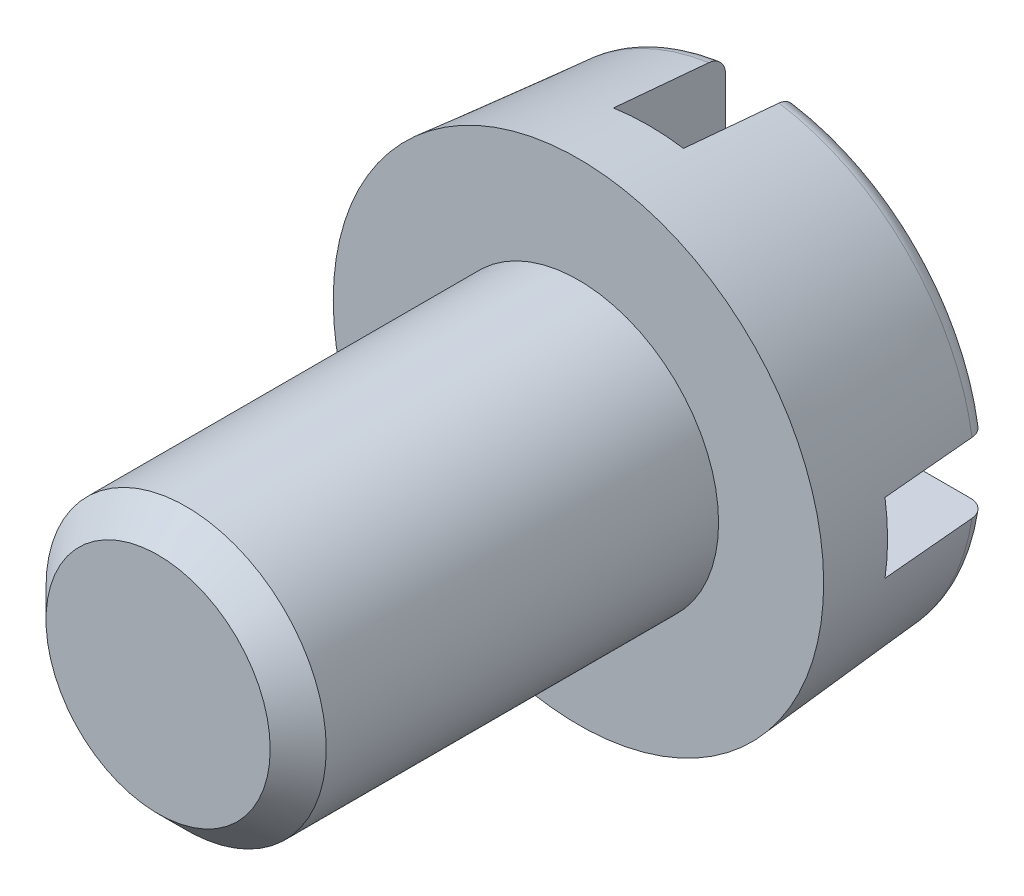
ISO-10303-21;
HEADER;
FILE_DESCRIPTION(('STEP AP214'),'2;1');
FILE_NAME('part.step','',(''),(''),'','','');
FILE_SCHEMA(('AUTOMOTIVE_DESIGN { 1 0 10303 214 1 1 1 1 }'));
ENDSEC;
DATA;
#1=APPLICATION_CONTEXT('core data for automotive mechanical design processes');
#2=APPLICATION_PROTOCOL_DEFINITION('international standard','automotive_design',2000,#1);
#3=PRODUCT_CONTEXT('',#1,'mechanical');
#4=PRODUCT('Part','Part','',(#3));
#5=PRODUCT_RELATED_PRODUCT_CATEGORY('part','',(#4));
#6=PRODUCT_DEFINITION_FORMATION('','',#4);
#7=PRODUCT_DEFINITION_CONTEXT('part definition',#1,'design');
#8=PRODUCT_DEFINITION('design','',#6,#7);
#9=PRODUCT_DEFINITION_SHAPE('','',#8);
#10=(LENGTH_UNIT() NAMED_UNIT(*) SI_UNIT(.MILLI.,.METRE.));
#11=(NAMED_UNIT(*) PLANE_ANGLE_UNIT() SI_UNIT($,.RADIAN.));
#12=(NAMED_UNIT(*) SI_UNIT($,.STERADIAN.) SOLID_ANGLE_UNIT());
#13=UNCERTAINTY_MEASURE_WITH_UNIT(LENGTH_MEASURE(1.E-05),#10,'distance_accuracy_value','');
#14=(GEOMETRIC_REPRESENTATION_CONTEXT(3) GLOBAL_UNCERTAINTY_ASSIGNED_CONTEXT((#13)) GLOBAL_UNIT_ASSIGNED_CONTEXT((#10,
#11,#12)) REPRESENTATION_CONTEXT('',''));
#15=CARTESIAN_POINT('',(0.,0.,0.));
#16=DIRECTION('',(0.,0.,1.));
#17=DIRECTION('',(1.,0.,0.));
#18=AXIS2_PLACEMENT_3D('',#15,#16,#17);
#19=CARTESIAN_POINT('',(0.,0.,-2.6));
#20=DIRECTION('',(0.,0.,1.));
#21=DIRECTION('',(1.,0.,0.));
#22=AXIS2_PLACEMENT_3D('',#19,#20,#21);
#23=PLANE('',#22);
#24=DIRECTION('',(0.,-1.,0.));
#25=VECTOR('',#24,1.);
#26=CARTESIAN_POINT('',(-0.499999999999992,3.5,-2.6));
#27=LINE('',#26,#25);
#28=CARTESIAN_POINT('',(-0.500000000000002,-0.499999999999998,-2.6));
#29=VERTEX_POINT('',#28);
#30=CARTESIAN_POINT('',(-0.500000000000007,-2.99280396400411,-2.6));
#31=VERTEX_POINT('',#30);
#32=EDGE_CURVE('E401',#29,#31,#27,.T.);
#33=ORIENTED_EDGE('',*,*,#32,.T.);
#34=CARTESIAN_POINT('',(0.,0.,-2.6));
#35=DIRECTION('',(0.,0.,-1.));
#36=DIRECTION('',(-1.,0.,0.));
#37=AXIS2_PLACEMENT_3D('',#34,#35,#36);
#38=CIRCLE('',#37,3.03428336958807);
#39=CARTESIAN_POINT('',(-2.99280396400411,-0.5,-2.6));
#40=VERTEX_POINT('',#39);
#41=EDGE_CURVE('E164',#31,#40,#38,.T.);
#42=ORIENTED_EDGE('',*,*,#41,.T.);
#43=DIRECTION('',(1.,0.,0.));
#44=VECTOR('',#43,1.);
#45=CARTESIAN_POINT('',(-3.5,-0.5,-2.6));
#46=LINE('',#45,#44);
#47=EDGE_CURVE('E306',#40,#29,#46,.T.);
#48=ORIENTED_EDGE('',*,*,#47,.T.);
#49=EDGE_LOOP('',(#33,#42,#48));
#50=FACE_BOUND('',#49,.T.);
#51=ADVANCED_FACE('F26',(#50),#23,.F.);
#52=DIRECTION('',(0.,1.,0.));
#53=VECTOR('',#52,1.);
#54=CARTESIAN_POINT('',(0.500000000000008,3.5,-2.6));
#55=LINE('',#54,#53);
#56=CARTESIAN_POINT('',(0.499999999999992,-2.99280396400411,-2.6));
#57=VERTEX_POINT('',#56);
#58=CARTESIAN_POINT('',(0.499999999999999,-0.499999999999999,-2.6));
#59=VERTEX_POINT('',#58);
#60=EDGE_CURVE('E137',#57,#59,#55,.T.);
#61=ORIENTED_EDGE('',*,*,#60,.T.);
#62=CARTESIAN_POINT('',(2.99280396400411,-0.5,-2.6));
#63=VERTEX_POINT('',#62);
#64=EDGE_CURVE('E161',#59,#63,#46,.T.);
#65=ORIENTED_EDGE('',*,*,#64,.T.);
#66=EDGE_CURVE('E154',#63,#57,#38,.T.);
#67=ORIENTED_EDGE('',*,*,#66,.T.);
#68=EDGE_LOOP('',(#61,#65,#67));
#69=FACE_BOUND('',#68,.T.);
#70=ADVANCED_FACE('F160',(#69),#23,.F.);
#71=CARTESIAN_POINT('',(-0.499999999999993,2.99280396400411,-2.6));
#72=VERTEX_POINT('',#71);
#73=CARTESIAN_POINT('',(-0.499999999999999,0.500000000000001,-2.6));
#74=VERTEX_POINT('',#73);
#75=EDGE_CURVE('E382',#72,#74,#27,.T.);
#76=ORIENTED_EDGE('',*,*,#75,.T.);
#77=DIRECTION('',(-1.,0.,0.));
#78=VECTOR('',#77,1.);
#79=CARTESIAN_POINT('',(-3.5,0.5,-2.6));
#80=LINE('',#79,#78);
#81=CARTESIAN_POINT('',(-2.99280396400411,0.5,-2.6));
#82=VERTEX_POINT('',#81);
#83=EDGE_CURVE('E309',#74,#82,#80,.T.);
#84=ORIENTED_EDGE('',*,*,#83,.T.);
#85=EDGE_CURVE('E166',#82,#72,#38,.T.);
#86=ORIENTED_EDGE('',*,*,#85,.T.);
#87=EDGE_LOOP('',(#76,#84,#86));
#88=FACE_BOUND('',#87,.T.);
#89=ADVANCED_FACE('F372',(#88),#23,.F.);
#90=CARTESIAN_POINT('',(0.500000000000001,0.500000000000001,-2.6));
#91=VERTEX_POINT('',#90);
#92=CARTESIAN_POINT('',(0.500000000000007,2.99280396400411,-2.6));
#93=VERTEX_POINT('',#92);
#94=EDGE_CURVE('E147',#91,#93,#55,.T.);
#95=ORIENTED_EDGE('',*,*,#94,.T.);
#96=CARTESIAN_POINT('',(2.99280396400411,0.5,-2.6));
#97=VERTEX_POINT('',#96);
#98=EDGE_CURVE('E163',#93,#97,#38,.T.);
#99=ORIENTED_EDGE('',*,*,#98,.T.);
#100=EDGE_CURVE('E310',#97,#91,#80,.T.);
#101=ORIENTED_EDGE('',*,*,#100,.T.);
#102=EDGE_LOOP('',(#95,#99,#101));
#103=FACE_BOUND('',#102,.T.);
#104=ADVANCED_FACE('F242',(#103),#23,.F.);
#105=CARTESIAN_POINT('',(0.,0.,-2.34));
#106=DIRECTION('',(0.,0.,-1.));
#107=DIRECTION('',(-1.,0.,0.));
#108=AXIS2_PLACEMENT_3D('',#105,#106,#107);
#109=TOROIDAL_SURFACE('',#108,3.03428336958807,0.26);
#110=CARTESIAN_POINT('',(-0.500000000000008,-3.21140457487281,-2.48500075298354));
#111=CARTESIAN_POINT('',(-0.500000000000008,-3.20312733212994,-2.49717229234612));
#112=CARTESIAN_POINT('',(-0.500000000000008,-3.19380624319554,-2.50864789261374));
#113=CARTESIAN_POINT('',(-0.500000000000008,-3.17335599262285,-2.52987478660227));
#114=CARTESIAN_POINT('',(-0.500000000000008,-3.16222442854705,-2.53962375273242));
#115=CARTESIAN_POINT('',(-0.500000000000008,-3.13849715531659,-2.55711146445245));
#116=CARTESIAN_POINT('',(-0.500000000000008,-3.12590291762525,-2.56485220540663));
#117=CARTESIAN_POINT('',(-0.500000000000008,-3.09960670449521,-2.57812866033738));
#118=CARTESIAN_POINT('',(-0.500000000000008,-3.08590500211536,-2.58366491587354));
#119=CARTESIAN_POINT('',(-0.500000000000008,-3.05764794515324,-2.59243368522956));
#120=CARTESIAN_POINT('',(-0.500000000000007,-3.04308601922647,-2.59564502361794));
#121=CARTESIAN_POINT('',(-0.500000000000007,-3.01363014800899,-2.59960185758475));
#122=CARTESIAN_POINT('',(-0.500000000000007,-2.99873616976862,-2.60034710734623));
#123=CARTESIAN_POINT('',(-0.500000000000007,-2.96889616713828,-2.59935058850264));
#124=CARTESIAN_POINT('',(-0.500000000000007,-2.95395089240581,-2.59758624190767));
#125=CARTESIAN_POINT('',(-0.500000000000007,-2.92456678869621,-2.59157836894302));
#126=CARTESIAN_POINT('',(-0.500000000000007,-2.91012797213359,-2.58733478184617));
#127=CARTESIAN_POINT('',(-0.500000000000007,-2.8821445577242,-2.57647231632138));
#128=CARTESIAN_POINT('',(-0.500000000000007,-2.86860150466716,-2.56984945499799));
#129=CARTESIAN_POINT('',(-0.500000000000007,-2.84283083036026,-2.55440735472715));
#130=CARTESIAN_POINT('',(-0.500000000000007,-2.8306031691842,-2.54558818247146));
#131=CARTESIAN_POINT('',(-0.500000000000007,-2.80791619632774,-2.52607013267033));
#132=CARTESIAN_POINT('',(-0.500000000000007,-2.79744404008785,-2.51538619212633));
#133=CARTESIAN_POINT('',(-0.500000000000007,-2.77847395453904,-2.49238924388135));
#134=CARTESIAN_POINT('',(-0.500000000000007,-2.76997587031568,-2.48007636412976));
#135=CARTESIAN_POINT('',(-0.500000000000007,-2.75532804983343,-2.4543612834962));
#136=CARTESIAN_POINT('',(-0.500000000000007,-2.74914608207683,-2.44097744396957));
#137=CARTESIAN_POINT('',(-0.500000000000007,-2.7391541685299,-2.41335185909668));
#138=CARTESIAN_POINT('',(-0.500000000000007,-2.73534400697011,-2.39911019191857));
#139=CARTESIAN_POINT('',(-0.500000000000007,-2.73025491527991,-2.37039211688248));
#140=CARTESIAN_POINT('',(-0.500000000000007,-2.72894057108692,-2.35592197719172));
#141=CARTESIAN_POINT('',(-0.500000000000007,-2.72877708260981,-2.32696815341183));
#142=CARTESIAN_POINT('',(-0.500000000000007,-2.72992781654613,-2.31248447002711));
#143=CARTESIAN_POINT('',(-0.500000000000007,-2.73464256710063,-2.28401045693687));
#144=CARTESIAN_POINT('',(-0.500000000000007,-2.73819125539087,-2.27001758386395));
#145=CARTESIAN_POINT('',(-0.500000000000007,-2.7475758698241,-2.24282165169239));
#146=CARTESIAN_POINT('',(-0.500000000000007,-2.75341182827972,-2.22961860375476));
#147=CARTESIAN_POINT('',(-0.500000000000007,-2.76722913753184,-2.20430052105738));
#148=CARTESIAN_POINT('',(-0.500000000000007,-2.77522127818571,-2.19219137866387));
#149=CARTESIAN_POINT('',(-0.500000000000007,-2.7930996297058,-2.16946355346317));
#150=CARTESIAN_POINT('',(-0.500000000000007,-2.80298596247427,-2.15884496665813));
#151=CARTESIAN_POINT('',(-0.500000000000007,-2.82451344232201,-2.13924450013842));
#152=CARTESIAN_POINT('',(-0.500000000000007,-2.83617654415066,-2.13028673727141));
#153=CARTESIAN_POINT('',(-0.500000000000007,-2.86082287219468,-2.11442237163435));
#154=CARTESIAN_POINT('',(-0.500000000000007,-2.87380620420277,-2.10751593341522));
#155=CARTESIAN_POINT('',(-0.500000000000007,-2.90093163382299,-2.09584572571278));
#156=CARTESIAN_POINT('',(-0.500000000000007,-2.91508805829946,-2.09111524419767));
#157=CARTESIAN_POINT('',(-0.500000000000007,-2.94399055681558,-2.08407372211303));
#158=CARTESIAN_POINT('',(-0.500000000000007,-2.95873666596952,-2.08176282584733));
#159=CARTESIAN_POINT('',(-0.500000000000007,-2.98854383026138,-2.07961287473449));
#160=CARTESIAN_POINT('',(-0.500000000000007,-3.00360653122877,-2.07979655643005));
#161=CARTESIAN_POINT('',(-0.500000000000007,-3.03348779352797,-2.08268964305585));
#162=CARTESIAN_POINT('',(-0.500000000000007,-3.04830635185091,-2.08539907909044));
#163=CARTESIAN_POINT('',(-0.500000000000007,-3.07727598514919,-2.09327533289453));
#164=CARTESIAN_POINT('',(-0.500000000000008,-3.09142706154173,-2.0984421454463));
#165=CARTESIAN_POINT('',(-0.500000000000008,-3.11865066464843,-2.11109710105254));
#166=CARTESIAN_POINT('',(-0.500000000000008,-3.1317232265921,-2.11858516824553));
#167=CARTESIAN_POINT('',(-0.500000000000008,-3.15630285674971,-2.13560939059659));
#168=CARTESIAN_POINT('',(-0.500000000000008,-3.16782171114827,-2.14512852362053));
#169=CARTESIAN_POINT('',(-0.500000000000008,-3.18907352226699,-2.16598685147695));
#170=CARTESIAN_POINT('',(-0.500000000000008,-3.19880658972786,-2.17732593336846));
#171=CARTESIAN_POINT('',(-0.500000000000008,-3.2160861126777,-2.20135675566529));
#172=CARTESIAN_POINT('',(-0.500000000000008,-3.2236573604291,-2.21403066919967));
#173=CARTESIAN_POINT('',(-0.500000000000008,-3.23653692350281,-2.24047987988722));
#174=CARTESIAN_POINT('',(-0.500000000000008,-3.24184547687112,-2.25425506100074));
#175=CARTESIAN_POINT('',(-0.500000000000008,-3.24999151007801,-2.28235214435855));
#176=CARTESIAN_POINT('',(-0.500000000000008,-3.25285565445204,-2.29666632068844));
#177=CARTESIAN_POINT('',(-0.500000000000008,-3.25612462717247,-2.32557668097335));
#178=CARTESIAN_POINT('',(-0.500000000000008,-3.25652893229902,-2.3401729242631));
#179=CARTESIAN_POINT('',(-0.500000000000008,-3.25486992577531,-2.36914232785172));
#180=CARTESIAN_POINT('',(-0.500000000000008,-3.25282012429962,-2.38351627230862));
#181=CARTESIAN_POINT('',(-0.500000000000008,-3.24633798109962,-2.411703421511));
#182=CARTESIAN_POINT('',(-0.500000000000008,-3.24190859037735,-2.42551729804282));
#183=CARTESIAN_POINT('',(-0.500000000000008,-3.23299711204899,-2.44694409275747));
#184=CARTESIAN_POINT('',(-0.500000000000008,-3.22922138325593,-2.45485842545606));
#185=CARTESIAN_POINT('',(-0.500000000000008,-3.22088857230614,-2.4702642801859));
#186=CARTESIAN_POINT('',(-0.500000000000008,-3.2163314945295,-2.477755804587));
#187=CARTESIAN_POINT('',(-0.500000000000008,-3.21140457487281,-2.48500075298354));
#188=B_SPLINE_CURVE_WITH_KNOTS('',3,(#110,#111,#112,#113,#114,#115,#116,#117,#118,#119,#120,
#121,#122,#123,#124,#125,#126,#127,#128,#129,#130,#131,#132,#133,#134,#135,#136,#137,#138,#139,
#140,#141,#142,#143,#144,#145,#146,#147,#148,#149,#150,#151,#152,#153,#154,#155,#156,#157,#158,
#159,#160,#161,#162,#163,#164,#165,#166,#167,#168,#169,#170,#171,#172,#173,#174,#175,#176,#177,
#178,#179,#180,#181,#182,#183,#184,#185,#186,#187),.UNSPECIFIED.,.T.,.F.,(4,2,2,2,2,2,2,2,2,2,2,
2,2,2,2,2,2,2,2,2,2,2,2,2,2,2,2,2,2,2,2,2,2,2,2,2,2,2,4),(0.,0.0441255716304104,
0.0883101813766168,0.132450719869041,0.176580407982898,0.221107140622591,0.265638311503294,
0.31057265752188,0.355508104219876,0.40051912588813,0.445528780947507,0.490193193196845,
0.534854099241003,0.578868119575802,0.622878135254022,0.666258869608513,0.709637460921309,
0.752741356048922,0.795845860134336,0.839170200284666,0.88249732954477,0.926411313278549,
0.970328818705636,1.01489749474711,1.05946882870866,1.10444667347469,1.14942507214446,
1.19440337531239,1.23938020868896,1.28399394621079,1.32860491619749,1.3726815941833,
1.4167536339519,1.46033853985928,1.50393271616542,1.54728800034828,1.59058964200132,
1.61685495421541,1.64312011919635),.UNSPECIFIED.);
#189=CARTESIAN_POINT('',(-0.500000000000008,-3.25511678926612,-2.36266049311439));
#190=VERTEX_POINT('',#189);
#191=EDGE_CURVE('E295',#190,#31,#188,.T.);
#192=ORIENTED_EDGE('',*,*,#191,.F.);
#193=CARTESIAN_POINT('',(0.,0.,-2.36266049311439));
#194=DIRECTION('',(0.,0.,-1.));
#195=DIRECTION('',(-1.,0.,0.));
#196=AXIS2_PLACEMENT_3D('',#193,#194,#195);
#197=CIRCLE('',#196,3.29329399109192);
#198=CARTESIAN_POINT('',(-3.25511678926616,-0.5,-2.3626604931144));
#199=VERTEX_POINT('',#198);
#200=EDGE_CURVE('E338',#190,#199,#197,.T.);
#201=ORIENTED_EDGE('',*,*,#200,.T.);
#202=CARTESIAN_POINT('',(-3.20593369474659,-0.5,-2.49273899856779));
#203=CARTESIAN_POINT('',(-3.21452220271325,-0.5,-2.48104813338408));
#204=CARTESIAN_POINT('',(-3.22213584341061,-0.5,-2.4686288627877));
#205=CARTESIAN_POINT('',(-3.23517931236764,-0.5,-2.44267992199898));
#206=CARTESIAN_POINT('',(-3.24060678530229,-0.5,-2.42914907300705));
#207=CARTESIAN_POINT('',(-3.2491065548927,-0.5,-2.40136759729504));
#208=CARTESIAN_POINT('',(-3.25217924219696,-0.5,-2.38711709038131));
#209=CARTESIAN_POINT('',(-3.25587593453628,-0.5,-2.35830538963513));
#210=CARTESIAN_POINT('',(-3.25650051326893,-0.5,-2.34374426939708));
#211=CARTESIAN_POINT('',(-3.25528642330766,-0.5,-2.31478610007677));
#212=CARTESIAN_POINT('',(-3.25345800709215,-0.5,-2.30038862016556));
#213=CARTESIAN_POINT('',(-3.24741106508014,-0.5,-2.27210454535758));
#214=CARTESIAN_POINT('',(-3.24319247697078,-0.5,-2.25821796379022));
#215=CARTESIAN_POINT('',(-3.23248845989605,-0.5,-2.23133883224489));
#216=CARTESIAN_POINT('',(-3.22600169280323,-0.5,-2.21834681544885));
#217=CARTESIAN_POINT('',(-3.21095392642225,-0.5,-2.1936258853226));
#218=CARTESIAN_POINT('',(-3.20239287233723,-0.5,-2.18189700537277));
#219=CARTESIAN_POINT('',(-3.1833771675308,-0.5,-2.1599421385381));
#220=CARTESIAN_POINT('',(-3.17290934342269,-0.5,-2.14972756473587));
#221=CARTESIAN_POINT('',(-3.15042433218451,-0.5,-2.13117694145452));
#222=CARTESIAN_POINT('',(-3.13840706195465,-0.5,-2.12284099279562));
#223=CARTESIAN_POINT('',(-3.11301845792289,-0.5,-2.10818216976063));
#224=CARTESIAN_POINT('',(-3.09963325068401,-0.5,-2.10188332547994));
#225=CARTESIAN_POINT('',(-3.07200360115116,-0.5,-2.09159292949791));
#226=CARTESIAN_POINT('',(-3.05775910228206,-0.5,-2.08760152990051));
#227=CARTESIAN_POINT('',(-3.02863847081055,-0.5,-2.08199385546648));
#228=CARTESIAN_POINT('',(-3.01375693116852,-0.5,-2.0804056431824));
#229=CARTESIAN_POINT('',(-2.98393701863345,-0.5,-2.07973102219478));
#230=CARTESIAN_POINT('',(-2.96899864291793,-0.5,-2.08064473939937));
#231=CARTESIAN_POINT('',(-2.93937852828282,-0.5,-2.08496295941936));
#232=CARTESIAN_POINT('',(-2.92469933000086,-0.5,-2.08838491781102));
#233=CARTESIAN_POINT('',(-2.89612444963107,-0.5,-2.09764767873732));
#234=CARTESIAN_POINT('',(-2.88222877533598,-0.5,-2.10348850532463));
#235=CARTESIAN_POINT('',(-2.85564093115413,-0.5,-2.11742304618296));
#236=CARTESIAN_POINT('',(-2.84294711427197,-0.5,-2.12551361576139));
#237=CARTESIAN_POINT('',(-2.81911627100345,-0.5,-2.14373207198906));
#238=CARTESIAN_POINT('',(-2.80797917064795,-0.5,-2.15385986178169));
#239=CARTESIAN_POINT('',(-2.78770744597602,-0.5,-2.175756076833));
#240=CARTESIAN_POINT('',(-2.77855308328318,-0.5,-2.18750622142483));
#241=CARTESIAN_POINT('',(-2.76238342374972,-0.5,-2.21239644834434));
#242=CARTESIAN_POINT('',(-2.75536793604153,-0.5,-2.22553640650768));
#243=CARTESIAN_POINT('',(-2.74378882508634,-0.5,-2.25261692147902));
#244=CARTESIAN_POINT('',(-2.73918923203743,-0.5,-2.26654210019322));
#245=CARTESIAN_POINT('',(-2.73242630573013,-0.5,-2.29497183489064));
#246=CARTESIAN_POINT('',(-2.7302627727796,-0.5,-2.3094763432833));
#247=CARTESIAN_POINT('',(-2.72845260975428,-0.5,-2.33846034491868));
#248=CARTESIAN_POINT('',(-2.72877510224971,-0.5,-2.35293791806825));
#249=CARTESIAN_POINT('',(-2.73185338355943,-0.5,-2.38163157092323));
#250=CARTESIAN_POINT('',(-2.73460910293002,-0.5,-2.39584765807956));
#251=CARTESIAN_POINT('',(-2.74245689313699,-0.5,-2.42357874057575));
#252=CARTESIAN_POINT('',(-2.74754285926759,-0.5,-2.43709546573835));
#253=CARTESIAN_POINT('',(-2.75989322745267,-0.5,-2.46309346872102));
#254=CARTESIAN_POINT('',(-2.76715770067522,-0.5,-2.4755747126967));
#255=CARTESIAN_POINT('',(-2.78371912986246,-0.5,-2.49926528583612));
#256=CARTESIAN_POINT('',(-2.79303287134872,-0.5,-2.51046287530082));
#257=CARTESIAN_POINT('',(-2.81338307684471,-0.5,-2.53116410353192));
#258=CARTESIAN_POINT('',(-2.82441967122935,-0.5,-2.54066761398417));
#259=CARTESIAN_POINT('',(-2.84807721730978,-0.5,-2.5578611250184));
#260=CARTESIAN_POINT('',(-2.86071925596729,-0.5,-2.56552211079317));
#261=CARTESIAN_POINT('',(-2.88709689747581,-0.5,-2.57864615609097));
#262=CARTESIAN_POINT('',(-2.90083258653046,-0.5,-2.58410904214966));
#263=CARTESIAN_POINT('',(-2.92920867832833,-0.5,-2.59275435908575));
#264=CARTESIAN_POINT('',(-2.94385884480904,-0.5,-2.59590476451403));
#265=CARTESIAN_POINT('',(-2.97347913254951,-0.5,-2.59971834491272));
#266=CARTESIAN_POINT('',(-2.98844925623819,-0.5,-2.60038150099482));
#267=CARTESIAN_POINT('',(-3.01838249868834,-0.5,-2.59919693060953));
#268=CARTESIAN_POINT('',(-3.03334500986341,-0.5,-2.5973337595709));
#269=CARTESIAN_POINT('',(-3.06274709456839,-0.5,-2.59111373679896));
#270=CARTESIAN_POINT('',(-3.0771865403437,-0.5,-2.58675628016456));
#271=CARTESIAN_POINT('',(-3.10508461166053,-0.5,-2.57567635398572));
#272=CARTESIAN_POINT('',(-3.11854561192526,-0.5,-2.56895985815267));
#273=CARTESIAN_POINT('',(-3.14412097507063,-0.5,-2.55334434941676));
#274=CARTESIAN_POINT('',(-3.15623699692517,-0.5,-2.544448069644));
#275=CARTESIAN_POINT('',(-3.17464140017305,-0.5,-2.5283401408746));
#276=CARTESIAN_POINT('',(-3.18144049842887,-0.5,-2.52170233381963));
#277=CARTESIAN_POINT('',(-3.19427675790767,-0.5,-2.50772663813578));
#278=CARTESIAN_POINT('',(-3.20031392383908,-0.5,-2.50038875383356));
#279=CARTESIAN_POINT('',(-3.20593369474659,-0.5,-2.49273899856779));
#280=B_SPLINE_CURVE_WITH_KNOTS('',3,(#202,#203,#204,#205,#206,#207,#208,#209,#210,#211,#212,
#213,#214,#215,#216,#217,#218,#219,#220,#221,#222,#223,#224,#225,#226,#227,#228,#229,#230,#231,
#232,#233,#234,#235,#236,#237,#238,#239,#240,#241,#242,#243,#244,#245,#246,#247,#248,#249,#250,
#251,#252,#253,#254,#255,#256,#257,#258,#259,#260,#261,#262,#263,#264,#265,#266,#267,#268,#269,
#270,#271,#272,#273,#274,#275,#276,#277,#278,#279),.UNSPECIFIED.,.T.,.F.,(4,2,2,2,2,2,2,2,2,2,2,
2,2,2,2,2,2,2,2,2,2,2,2,2,2,2,2,2,2,2,2,2,2,2,2,2,2,2,4),(0.,0.0434852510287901,
0.0870172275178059,0.130541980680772,0.174056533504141,0.217389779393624,0.260724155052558,
0.304084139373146,0.347445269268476,0.391118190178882,0.434793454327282,0.478966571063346,
0.523142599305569,0.567830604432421,0.612520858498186,0.657525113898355,0.702529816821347,
0.74747192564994,0.792411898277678,0.836881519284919,0.881347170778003,0.925130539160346,
0.968910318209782,1.01214721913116,1.05538288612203,1.0985059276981,1.14163037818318,
1.18512216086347,1.22861723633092,1.27275797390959,1.31690219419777,1.36164679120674,
1.40639172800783,1.45141144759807,1.4964420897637,1.54135951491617,1.58622090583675,
1.61467505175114,1.64312902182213),.UNSPECIFIED.);
#281=EDGE_CURVE('E231',#40,#199,#280,.T.);
#282=ORIENTED_EDGE('',*,*,#281,.F.);
#283=ORIENTED_EDGE('',*,*,#41,.F.);
#284=EDGE_LOOP('',(#192,#201,#282,#283));
#285=FACE_BOUND('',#284,.T.);
#286=ADVANCED_FACE('F239',(#285),#109,.T.);
#287=CARTESIAN_POINT('',(0.499999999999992,-3.21140457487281,-2.48500075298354));
#288=CARTESIAN_POINT('',(0.499999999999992,-3.21955488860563,-2.47301353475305));
#289=CARTESIAN_POINT('',(0.499999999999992,-3.22670474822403,-2.46033414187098));
#290=CARTESIAN_POINT('',(0.499999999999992,-3.2387827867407,-2.4339460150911));
#291=CARTESIAN_POINT('',(0.499999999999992,-3.2437085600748,-2.42023618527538));
#292=CARTESIAN_POINT('',(0.499999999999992,-3.2511821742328,-2.39218423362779));
#293=CARTESIAN_POINT('',(0.499999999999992,-3.25373047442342,-2.37784223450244));
#294=CARTESIAN_POINT('',(0.499999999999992,-3.25637189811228,-2.3489373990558));
#295=CARTESIAN_POINT('',(0.499999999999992,-3.25646559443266,-2.33437461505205));
#296=CARTESIAN_POINT('',(0.499999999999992,-3.2542009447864,-2.30549502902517));
#297=CARTESIAN_POINT('',(0.499999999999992,-3.25185160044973,-2.2911775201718));
#298=CARTESIAN_POINT('',(0.499999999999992,-3.24478546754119,-2.26313904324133));
#299=CARTESIAN_POINT('',(0.499999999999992,-3.24006860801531,-2.24941809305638));
#300=CARTESIAN_POINT('',(0.499999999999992,-3.22840050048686,-2.22293999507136));
#301=CARTESIAN_POINT('',(0.499999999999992,-3.22144624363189,-2.21018417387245));
#302=CARTESIAN_POINT('',(0.499999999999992,-3.20551063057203,-2.18600927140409));
#303=CARTESIAN_POINT('',(0.499999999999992,-3.19652921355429,-2.17459023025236));
#304=CARTESIAN_POINT('',(0.499999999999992,-3.176722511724,-2.15331506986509));
#305=CARTESIAN_POINT('',(0.499999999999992,-3.1658834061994,-2.14347182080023));
#306=CARTESIAN_POINT('',(0.499999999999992,-3.14272292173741,-2.12571974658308));
#307=CARTESIAN_POINT('',(0.499999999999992,-3.13040146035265,-2.11781102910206));
#308=CARTESIAN_POINT('',(0.499999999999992,-3.10447316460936,-2.10405406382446));
#309=CARTESIAN_POINT('',(0.499999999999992,-3.0908530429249,-2.09823086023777));
#310=CARTESIAN_POINT('',(0.499999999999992,-3.06283552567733,-2.08892472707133));
#311=CARTESIAN_POINT('',(0.499999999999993,-3.04843807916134,-2.08544195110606));
#312=CARTESIAN_POINT('',(0.499999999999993,-3.01910005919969,-2.08087785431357));
#313=CARTESIAN_POINT('',(0.499999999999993,-3.00415518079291,-2.07982418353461));
#314=CARTESIAN_POINT('',(0.499999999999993,-2.9742986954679,-2.08022369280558));
#315=CARTESIAN_POINT('',(0.499999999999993,-2.95938709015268,-2.08167699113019));
#316=CARTESIAN_POINT('',(0.499999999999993,-2.92992245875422,-2.08706726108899));
#317=CARTESIAN_POINT('',(0.499999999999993,-2.91537226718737,-2.09101974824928));
#318=CARTESIAN_POINT('',(0.499999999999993,-2.88714389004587,-2.10131686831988));
#319=CARTESIAN_POINT('',(0.499999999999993,-2.8734657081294,-2.10766151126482));
#320=CARTESIAN_POINT('',(0.499999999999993,-2.84741004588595,-2.12255473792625));
#321=CARTESIAN_POINT('',(0.499999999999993,-2.83502950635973,-2.13109796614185));
#322=CARTESIAN_POINT('',(0.499999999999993,-2.81189911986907,-2.15016364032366));
#323=CARTESIAN_POINT('',(0.499999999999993,-2.80114918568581,-2.16068598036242));
#324=CARTESIAN_POINT('',(0.499999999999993,-2.78171934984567,-2.18328779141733));
#325=CARTESIAN_POINT('',(0.499999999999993,-2.77301746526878,-2.19534835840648));
#326=CARTESIAN_POINT('',(0.499999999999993,-2.7577994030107,-2.2207777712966));
#327=CARTESIAN_POINT('',(0.499999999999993,-2.75128302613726,-2.23414649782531));
#328=CARTESIAN_POINT('',(0.499999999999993,-2.74072609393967,-2.26159111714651));
#329=CARTESIAN_POINT('',(0.499999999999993,-2.73664888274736,-2.27565291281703));
#330=CARTESIAN_POINT('',(0.499999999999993,-2.73094427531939,-2.30426474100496));
#331=CARTESIAN_POINT('',(0.499999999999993,-2.72931668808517,-2.31881473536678));
#332=CARTESIAN_POINT('',(0.499999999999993,-2.72856769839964,-2.3478093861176));
#333=CARTESIAN_POINT('',(0.499999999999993,-2.72941742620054,-2.36225330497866));
#334=CARTESIAN_POINT('',(0.499999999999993,-2.73353378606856,-2.39079206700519));
#335=CARTESIAN_POINT('',(0.499999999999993,-2.73680036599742,-2.40488691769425));
#336=CARTESIAN_POINT('',(0.499999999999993,-2.74564225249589,-2.43231092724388));
#337=CARTESIAN_POINT('',(0.499999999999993,-2.75121443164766,-2.44564109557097));
#338=CARTESIAN_POINT('',(0.499999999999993,-2.76449720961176,-2.47118905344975));
#339=CARTESIAN_POINT('',(0.499999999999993,-2.77220789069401,-2.48340680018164));
#340=CARTESIAN_POINT('',(0.499999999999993,-2.78962203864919,-2.50651126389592));
#341=CARTESIAN_POINT('',(0.499999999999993,-2.79934376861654,-2.51738421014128));
#342=CARTESIAN_POINT('',(0.499999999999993,-2.82045028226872,-2.53737370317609));
#343=CARTESIAN_POINT('',(0.499999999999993,-2.83183519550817,-2.54649011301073));
#344=CARTESIAN_POINT('',(0.499999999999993,-2.85612861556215,-2.56285341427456));
#345=CARTESIAN_POINT('',(0.499999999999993,-2.86905750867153,-2.57007004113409));
#346=CARTESIAN_POINT('',(0.499999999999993,-2.89593186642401,-2.58226271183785));
#347=CARTESIAN_POINT('',(0.499999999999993,-2.90987740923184,-2.58723858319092));
#348=CARTESIAN_POINT('',(0.499999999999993,-2.93858488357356,-2.5948704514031));
#349=CARTESIAN_POINT('',(0.499999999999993,-2.95335509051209,-2.59749534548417));
#350=CARTESIAN_POINT('',(0.499999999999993,-2.98312618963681,-2.60024265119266));
#351=CARTESIAN_POINT('',(0.499999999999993,-2.99812708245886,-2.6003650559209));
#352=CARTESIAN_POINT('',(0.499999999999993,-3.02801581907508,-2.5980954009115));
#353=CARTESIAN_POINT('',(0.499999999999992,-3.04290268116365,-2.59569037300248));
#354=CARTESIAN_POINT('',(0.499999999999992,-3.07206247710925,-2.58840457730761));
#355=CARTESIAN_POINT('',(0.499999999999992,-3.08633526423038,-2.58352322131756));
#356=CARTESIAN_POINT('',(0.499999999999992,-3.11380014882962,-2.57143520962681));
#357=CARTESIAN_POINT('',(0.499999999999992,-3.12699578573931,-2.56423658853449));
#358=CARTESIAN_POINT('',(0.499999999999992,-3.15196175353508,-2.54770821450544));
#359=CARTESIAN_POINT('',(0.499999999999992,-3.16373384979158,-2.53838114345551));
#360=CARTESIAN_POINT('',(0.499999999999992,-3.18150856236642,-2.52163259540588));
#361=CARTESIAN_POINT('',(0.499999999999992,-3.18804366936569,-2.51476687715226));
#362=CARTESIAN_POINT('',(0.499999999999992,-3.20032967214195,-2.50036613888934));
#363=CARTESIAN_POINT('',(0.499999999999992,-3.20608057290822,-2.49283112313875));
#364=CARTESIAN_POINT('',(0.499999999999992,-3.21140457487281,-2.48500075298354));
#365=B_SPLINE_CURVE_WITH_KNOTS('',3,(#287,#288,#289,#290,#291,#292,#293,#294,#295,#296,#297,
#298,#299,#300,#301,#302,#303,#304,#305,#306,#307,#308,#309,#310,#311,#312,#313,#314,#315,#316,
#317,#318,#319,#320,#321,#322,#323,#324,#325,#326,#327,#328,#329,#330,#331,#332,#333,#334,#335,
#336,#337,#338,#339,#340,#341,#342,#343,#344,#345,#346,#347,#348,#349,#350,#351,#352,#353,#354,
#355,#356,#357,#358,#359,#360,#361,#362,#363,#364),.UNSPECIFIED.,.T.,.F.,(4,2,2,2,2,2,2,2,2,2,2,
2,2,2,2,2,2,2,2,2,2,2,2,2,2,2,2,2,2,2,2,2,2,2,2,2,2,2,4),(0.,0.0434524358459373,
0.0869517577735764,0.130442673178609,0.173923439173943,0.217244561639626,0.260566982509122,
0.303947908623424,0.347330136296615,0.391050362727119,0.434773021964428,0.479004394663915,
0.523238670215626,0.567974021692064,0.612711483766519,0.657729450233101,0.702747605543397,
0.747657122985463,0.792564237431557,0.836964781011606,0.881361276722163,0.925072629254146,
0.968780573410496,1.01198120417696,1.05518090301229,1.09832219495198,1.14146514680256,
1.18501859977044,1.22857544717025,1.27278911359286,1.31700618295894,1.36179994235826,
1.40659382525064,1.45161867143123,1.49665421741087,1.54153526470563,1.58636007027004,
1.61474453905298,1.64312882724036),.UNSPECIFIED.);
#366=CARTESIAN_POINT('',(0.499999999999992,-3.25511678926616,-2.3626604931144));
#367=VERTEX_POINT('',#366);
#368=EDGE_CURVE('E140',#57,#367,#365,.T.);
#369=ORIENTED_EDGE('',*,*,#368,.F.);
#370=ORIENTED_EDGE('',*,*,#66,.F.);
#371=CARTESIAN_POINT('',(2.77362660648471,-0.5,-2.48479543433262));
#372=CARTESIAN_POINT('',(2.76548434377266,-0.5,-2.47284351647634));
#373=CARTESIAN_POINT('',(2.75833631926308,-0.5,-2.46020266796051));
#374=CARTESIAN_POINT('',(2.74625336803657,-0.5,-2.4338924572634));
#375=CARTESIAN_POINT('',(2.74132071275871,-0.5,-2.42022205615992));
#376=CARTESIAN_POINT('',(2.73382888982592,-0.5,-2.3922442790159));
#377=CARTESIAN_POINT('',(2.73126965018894,-0.5,-2.37793692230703));
#378=CARTESIAN_POINT('',(2.72860695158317,-0.5,-2.34909883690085));
#379=CARTESIAN_POINT('',(2.72850291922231,-0.5,-2.33456816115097));
#380=CARTESIAN_POINT('',(2.73074543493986,-0.5,-2.30578417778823));
#381=CARTESIAN_POINT('',(2.73307747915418,-0.5,-2.29152973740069));
#382=CARTESIAN_POINT('',(2.74009676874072,-0.5,-2.26361314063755));
#383=CARTESIAN_POINT('',(2.74478408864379,-0.5,-2.24995100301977));
#384=CARTESIAN_POINT('',(2.75638249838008,-0.5,-2.2235704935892));
#385=CARTESIAN_POINT('',(2.76329847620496,-0.5,-2.21085427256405));
#386=CARTESIAN_POINT('',(2.77914304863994,-0.5,-2.18674511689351));
#387=CARTESIAN_POINT('',(2.78807174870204,-0.5,-2.17535225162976));
#388=CARTESIAN_POINT('',(2.80779938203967,-0.5,-2.15406460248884));
#389=CARTESIAN_POINT('',(2.81861943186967,-0.5,-2.14418939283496));
#390=CARTESIAN_POINT('',(2.84174230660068,-0.5,-2.12636266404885));
#391=CARTESIAN_POINT('',(2.8540452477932,-0.5,-2.11841129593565));
#392=CARTESIAN_POINT('',(2.87998625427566,-0.5,-2.10453163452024));
#393=CARTESIAN_POINT('',(2.89364181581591,-0.5,-2.09863603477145));
#394=CARTESIAN_POINT('',(2.92174199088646,-0.5,-2.08919230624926));
#395=CARTESIAN_POINT('',(2.93618665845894,-0.5,-2.0856443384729));
#396=CARTESIAN_POINT('',(2.96562688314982,-0.5,-2.08096320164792));
#397=CARTESIAN_POINT('',(2.98062677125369,-0.5,-2.07985722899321));
#398=CARTESIAN_POINT('',(3.01060035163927,-0.5,-2.08017230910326));
#399=CARTESIAN_POINT('',(3.02557404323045,-0.5,-2.08159342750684));
#400=CARTESIAN_POINT('',(3.05510647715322,-0.5,-2.0869352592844));
#401=CARTESIAN_POINT('',(3.06966413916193,-0.5,-2.09086195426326));
#402=CARTESIAN_POINT('',(3.09790702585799,-0.5,-2.10111896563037));
#403=CARTESIAN_POINT('',(3.1115922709,-0.5,-2.10744922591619));
#404=CARTESIAN_POINT('',(3.13760610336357,-0.5,-2.12229619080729));
#405=CARTESIAN_POINT('',(3.14994271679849,-0.5,-2.13079882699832));
#406=CARTESIAN_POINT('',(3.17299205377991,-0.5,-2.14977690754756));
#407=CARTESIAN_POINT('',(3.18370487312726,-0.5,-2.16025223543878));
#408=CARTESIAN_POINT('',(3.2030703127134,-0.5,-2.18275038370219));
#409=CARTESIAN_POINT('',(3.21174515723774,-0.5,-2.19475407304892));
#410=CARTESIAN_POINT('',(3.22692841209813,-0.5,-2.22006136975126));
#411=CARTESIAN_POINT('',(3.23343696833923,-0.5,-2.23336488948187));
#412=CARTESIAN_POINT('',(3.24402537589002,-0.5,-2.26072709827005));
#413=CARTESIAN_POINT('',(3.24813264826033,-0.5,-2.27477517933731));
#414=CARTESIAN_POINT('',(3.25391041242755,-0.5,-2.30336369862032));
#415=CARTESIAN_POINT('',(3.2555810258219,-0.5,-2.31790411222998));
#416=CARTESIAN_POINT('',(3.25643125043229,-0.5,-2.34694784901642));
#417=CARTESIAN_POINT('',(3.25562947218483,-0.5,-2.36145063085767));
#418=CARTESIAN_POINT('',(3.25159984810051,-0.5,-2.39011483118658));
#419=CARTESIAN_POINT('',(3.24837204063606,-0.5,-2.40427625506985));
#420=CARTESIAN_POINT('',(3.23959162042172,-0.5,-2.43184461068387));
#421=CARTESIAN_POINT('',(3.2340410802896,-0.5,-2.44525220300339));
#422=CARTESIAN_POINT('',(3.22078064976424,-0.5,-2.47095278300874));
#423=CARTESIAN_POINT('',(3.21307071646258,-0.5,-2.48324574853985));
#424=CARTESIAN_POINT('',(3.19566551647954,-0.5,-2.50644928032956));
#425=CARTESIAN_POINT('',(3.18595873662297,-0.5,-2.51735120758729));
#426=CARTESIAN_POINT('',(3.1648702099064,-0.5,-2.53739204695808));
#427=CARTESIAN_POINT('',(3.15348837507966,-0.5,-2.54653086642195));
#428=CARTESIAN_POINT('',(3.12924254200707,-0.5,-2.56289277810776));
#429=CARTESIAN_POINT('',(3.1163638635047,-0.5,-2.57009411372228));
#430=CARTESIAN_POINT('',(3.08959088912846,-0.5,-2.58226175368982));
#431=CARTESIAN_POINT('',(3.07569652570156,-0.5,-2.58722790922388));
#432=CARTESIAN_POINT('',(3.04710871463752,-0.5,-2.5948446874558));
#433=CARTESIAN_POINT('',(3.03240769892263,-0.5,-2.59746691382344));
#434=CARTESIAN_POINT('',(3.00277466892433,-0.5,-2.60022853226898));
#435=CARTESIAN_POINT('',(2.98784265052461,-0.5,-2.60036788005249));
#436=CARTESIAN_POINT('',(2.95804002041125,-0.5,-2.5981541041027));
#437=CARTESIAN_POINT('',(2.9431709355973,-0.5,-2.59578037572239));
#438=CARTESIAN_POINT('',(2.91403721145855,-0.5,-2.58857139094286));
#439=CARTESIAN_POINT('',(2.89977273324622,-0.5,-2.58373548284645));
#440=CARTESIAN_POINT('',(2.87224730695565,-0.5,-2.57172586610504));
#441=CARTESIAN_POINT('',(2.85898742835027,-0.5,-2.56454970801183));
#442=CARTESIAN_POINT('',(2.83388686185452,-0.5,-2.54805876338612));
#443=CARTESIAN_POINT('',(2.82204445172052,-0.5,-2.53874661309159));
#444=CARTESIAN_POINT('',(2.80406578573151,-0.5,-2.5219325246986));
#445=CARTESIAN_POINT('',(2.79740698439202,-0.5,-2.51498036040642));
#446=CARTESIAN_POINT('',(2.78489446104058,-0.5,-2.50038547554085));
#447=CARTESIAN_POINT('',(2.77904073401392,-0.5,-2.49274275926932));
#448=CARTESIAN_POINT('',(2.77362660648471,-0.5,-2.48479543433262));
#449=B_SPLINE_CURVE_WITH_KNOTS('',3,(#371,#372,#373,#374,#375,#376,#377,#378,#379,#380,#381,
#382,#383,#384,#385,#386,#387,#388,#389,#390,#391,#392,#393,#394,#395,#396,#397,#398,#399,#400,
#401,#402,#403,#404,#405,#406,#407,#408,#409,#410,#411,#412,#413,#414,#415,#416,#417,#418,#419,
#420,#421,#422,#423,#424,#425,#426,#427,#428,#429,#430,#431,#432,#433,#434,#435,#436,#437,#438,
#439,#440,#441,#442,#443,#444,#445,#446,#447,#448),.UNSPECIFIED.,.T.,.F.,(4,2,2,2,2,2,2,2,2,2,2,
2,2,2,2,2,2,2,2,2,2,2,2,2,2,2,2,2,2,2,2,2,2,2,2,2,2,2,4),(0.,0.0433509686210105,
0.086746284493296,0.130140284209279,0.173524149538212,0.216651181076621,0.259779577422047,
0.303003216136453,0.346229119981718,0.389972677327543,0.433719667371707,0.478133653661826,
0.522550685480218,0.567459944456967,0.612370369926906,0.657388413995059,0.702405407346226,
0.747137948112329,0.791867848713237,0.836084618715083,0.880298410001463,0.923996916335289,
0.967693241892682,1.01106145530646,1.05442898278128,1.09775789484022,1.14108766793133,
1.18467464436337,1.22826391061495,1.27232395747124,1.3163869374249,1.36097676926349,
1.40556739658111,1.45052647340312,1.49549745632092,1.5405156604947,1.58547859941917,
1.61430463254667,1.64313048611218),.UNSPECIFIED.);
#450=CARTESIAN_POINT('',(3.25511678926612,-0.5,-2.36266049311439));
#451=VERTEX_POINT('',#450);
#452=EDGE_CURVE('E227',#451,#63,#449,.T.);
#453=ORIENTED_EDGE('',*,*,#452,.F.);
#454=EDGE_CURVE('E156',#451,#367,#197,.T.);
#455=ORIENTED_EDGE('',*,*,#454,.T.);
#456=EDGE_LOOP('',(#369,#370,#453,#455));
#457=FACE_BOUND('',#456,.T.);
#458=ADVANCED_FACE('F152',(#457),#109,.T.);
#459=CARTESIAN_POINT('',(-0.499999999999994,2.75282254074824,-2.44818941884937));
#460=CARTESIAN_POINT('',(-0.499999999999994,2.75900872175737,-2.46148850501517));
#461=CARTESIAN_POINT('',(-0.499999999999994,2.76633613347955,-2.47426953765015));
#462=CARTESIAN_POINT('',(-0.499999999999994,2.78304758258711,-2.49842419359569));
#463=CARTESIAN_POINT('',(-0.499999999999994,2.79243442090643,-2.5097958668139));
#464=CARTESIAN_POINT('',(-0.499999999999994,2.81296729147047,-2.53079654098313));
#465=CARTESIAN_POINT('',(-0.499999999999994,2.82411131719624,-2.54042750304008));
#466=CARTESIAN_POINT('',(-0.499999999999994,2.84783890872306,-2.55770369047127));
#467=CARTESIAN_POINT('',(-0.499999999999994,2.86042212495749,-2.56534939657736));
#468=CARTESIAN_POINT('',(-0.499999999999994,2.88682472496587,-2.57853522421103));
#469=CARTESIAN_POINT('',(-0.499999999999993,2.90065642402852,-2.58405068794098));
#470=CARTESIAN_POINT('',(-0.499999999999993,2.9290443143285,-2.59270894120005));
#471=CARTESIAN_POINT('',(-0.499999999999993,2.94360058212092,-2.59585147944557));
#472=CARTESIAN_POINT('',(-0.499999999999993,2.97318737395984,-2.59970054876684));
#473=CARTESIAN_POINT('',(-0.499999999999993,2.98822126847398,-2.60038122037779));
#474=CARTESIAN_POINT('',(-0.499999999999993,3.01819091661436,-2.59921371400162));
#475=CARTESIAN_POINT('',(-0.499999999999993,3.03312666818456,-2.5973654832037));
#476=CARTESIAN_POINT('',(-0.499999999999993,3.0624993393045,-2.5911803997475));
#477=CARTESIAN_POINT('',(-0.499999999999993,3.07693542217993,-2.58683956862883));
#478=CARTESIAN_POINT('',(-0.499999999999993,3.1048661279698,-2.57577927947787));
#479=CARTESIAN_POINT('',(-0.499999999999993,3.11836077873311,-2.56905989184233));
#480=CARTESIAN_POINT('',(-0.499999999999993,3.14392242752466,-2.55347814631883));
#481=CARTESIAN_POINT('',(-0.499999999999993,3.15599866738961,-2.5446309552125));
#482=CARTESIAN_POINT('',(-0.499999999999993,3.1784720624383,-2.52501259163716));
#483=CARTESIAN_POINT('',(-0.499999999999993,3.18886931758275,-2.51424153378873));
#484=CARTESIAN_POINT('',(-0.499999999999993,3.2075592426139,-2.4912155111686));
#485=CARTESIAN_POINT('',(-0.499999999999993,3.21587508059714,-2.47897935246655));
#486=CARTESIAN_POINT('',(-0.499999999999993,3.2303064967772,-2.45327176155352));
#487=CARTESIAN_POINT('',(-0.499999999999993,3.23642222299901,-2.43980041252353));
#488=CARTESIAN_POINT('',(-0.499999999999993,3.24620887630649,-2.41217109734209));
#489=CARTESIAN_POINT('',(-0.499999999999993,3.24990699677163,-2.39802276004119));
#490=CARTESIAN_POINT('',(-0.499999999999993,3.25485668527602,-2.36930454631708));
#491=CARTESIAN_POINT('',(-0.499999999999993,3.25610836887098,-2.35473468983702));
#492=CARTESIAN_POINT('',(-0.499999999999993,3.25612699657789,-2.32569606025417));
#493=CARTESIAN_POINT('',(-0.499999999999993,3.25491130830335,-2.31122729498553));
#494=CARTESIAN_POINT('',(-0.499999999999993,3.25006698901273,-2.2826998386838));
#495=CARTESIAN_POINT('',(-0.499999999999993,3.24643838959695,-2.26864114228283));
#496=CARTESIAN_POINT('',(-0.499999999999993,3.23687880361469,-2.24133475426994));
#497=CARTESIAN_POINT('',(-0.499999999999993,3.23094848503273,-2.22808682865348));
#498=CARTESIAN_POINT('',(-0.499999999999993,3.21696157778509,-2.20276596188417));
#499=CARTESIAN_POINT('',(-0.499999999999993,3.20890493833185,-2.19069304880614));
#500=CARTESIAN_POINT('',(-0.499999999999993,3.19084234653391,-2.16797856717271));
#501=CARTESIAN_POINT('',(-0.499999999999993,3.18082415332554,-2.1573467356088));
#502=CARTESIAN_POINT('',(-0.499999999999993,3.15916239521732,-2.13789349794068));
#503=CARTESIAN_POINT('',(-0.499999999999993,3.14751874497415,-2.12907218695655));
#504=CARTESIAN_POINT('',(-0.499999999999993,3.12279979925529,-2.11338514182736));
#505=CARTESIAN_POINT('',(-0.499999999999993,3.10971009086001,-2.10654212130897));
#506=CARTESIAN_POINT('',(-0.499999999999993,3.08257730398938,-2.09512138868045));
#507=CARTESIAN_POINT('',(-0.499999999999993,3.06853416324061,-2.09054382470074));
#508=CARTESIAN_POINT('',(-0.499999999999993,3.03971531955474,-2.08372945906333));
#509=CARTESIAN_POINT('',(-0.499999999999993,3.02493291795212,-2.08152097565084));
#510=CARTESIAN_POINT('',(-0.499999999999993,2.9952065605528,-2.07959582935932));
#511=CARTESIAN_POINT('',(-0.499999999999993,2.98026259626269,-2.07987929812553));
#512=CARTESIAN_POINT('',(-0.499999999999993,2.95051315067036,-2.08294005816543));
#513=CARTESIAN_POINT('',(-0.499999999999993,2.93570967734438,-2.08573690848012));
#514=CARTESIAN_POINT('',(-0.499999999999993,2.90678182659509,-2.09377622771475));
#515=CARTESIAN_POINT('',(-0.499999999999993,2.8926574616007,-2.099018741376));
#516=CARTESIAN_POINT('',(-0.499999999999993,2.86549649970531,-2.11180815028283));
#517=CARTESIAN_POINT('',(-0.499999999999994,2.85245967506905,-2.11935456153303));
#518=CARTESIAN_POINT('',(-0.499999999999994,2.82785357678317,-2.13654863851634));
#519=CARTESIAN_POINT('',(-0.499999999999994,2.81628424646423,-2.14619622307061));
#520=CARTESIAN_POINT('',(-0.499999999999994,2.79506354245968,-2.16722633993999));
#521=CARTESIAN_POINT('',(-0.499999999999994,2.78539510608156,-2.17859164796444));
#522=CARTESIAN_POINT('',(-0.499999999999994,2.76813893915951,-2.20280481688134));
#523=CARTESIAN_POINT('',(-0.499999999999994,2.76055094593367,-2.21565249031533));
#524=CARTESIAN_POINT('',(-0.499999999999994,2.74779347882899,-2.24225641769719));
#525=CARTESIAN_POINT('',(-0.499999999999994,2.74258893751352,-2.25599585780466));
#526=CARTESIAN_POINT('',(-0.499999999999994,2.73459425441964,-2.28416417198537));
#527=CARTESIAN_POINT('',(-0.499999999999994,2.73180452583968,-2.29859316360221));
#528=CARTESIAN_POINT('',(-0.499999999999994,2.72875029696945,-2.32752812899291));
#529=CARTESIAN_POINT('',(-0.499999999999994,2.72845409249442,-2.34203078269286));
#530=CARTESIAN_POINT('',(-0.499999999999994,2.73031429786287,-2.37086518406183));
#531=CARTESIAN_POINT('',(-0.499999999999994,2.73246757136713,-2.3851971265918));
#532=CARTESIAN_POINT('',(-0.499999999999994,2.73780839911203,-2.40765591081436));
#533=CARTESIAN_POINT('',(-0.499999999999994,2.74023722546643,-2.41597074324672));
#534=CARTESIAN_POINT('',(-0.499999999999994,2.74591909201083,-2.43231365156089));
#535=CARTESIAN_POINT('',(-0.499999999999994,2.74917212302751,-2.44034173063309));
#536=CARTESIAN_POINT('',(-0.499999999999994,2.75282254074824,-2.44818941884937));
#537=B_SPLINE_CURVE_WITH_KNOTS('',3,(#459,#460,#461,#462,#463,#464,#465,#466,#467,#468,#469,
#470,#471,#472,#473,#474,#475,#476,#477,#478,#479,#480,#481,#482,#483,#484,#485,#486,#487,#488,
#489,#490,#491,#492,#493,#494,#495,#496,#497,#498,#499,#500,#501,#502,#503,#504,#505,#506,#507,
#508,#509,#510,#511,#512,#513,#514,#515,#516,#517,#518,#519,#520,#521,#522,#523,#524,#525,#526,
#527,#528,#529,#530,#531,#532,#533,#534,#535,#536),.UNSPECIFIED.,.T.,.F.,(4,2,2,2,2,2,2,2,2,2,2,
2,2,2,2,2,2,2,2,2,2,2,2,2,2,2,2,2,2,2,2,2,2,2,2,2,2,2,4),(0.,0.0439701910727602,
0.0880005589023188,0.131981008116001,0.175950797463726,0.22041529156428,0.264884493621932,
0.309819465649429,0.354755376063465,0.399763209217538,0.444769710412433,0.489464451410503,
0.534156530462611,0.578326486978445,0.622493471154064,0.666154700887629,0.709813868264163,
0.753166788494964,0.796519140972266,0.839858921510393,0.883199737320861,0.926820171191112,
0.970442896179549,1.0145482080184,1.05865640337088,1.10328615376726,1.14791826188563,
1.19290073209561,1.23788402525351,1.28285787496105,1.32782998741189,1.3723778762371,
1.41692013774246,1.46078415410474,1.50465567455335,1.54796852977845,1.59122598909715,
1.61717274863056,1.64311921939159),.UNSPECIFIED.);
#538=CARTESIAN_POINT('',(-0.499999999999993,3.25511678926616,-2.3626604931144));
#539=VERTEX_POINT('',#538);
#540=EDGE_CURVE('E268',#72,#539,#537,.T.);
#541=ORIENTED_EDGE('',*,*,#540,.F.);
#542=ORIENTED_EDGE('',*,*,#85,.F.);
#543=CARTESIAN_POINT('',(-3.20593369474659,0.5,-2.49273899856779));
#544=CARTESIAN_POINT('',(-3.19720688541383,0.5,-2.50461588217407));
#545=CARTESIAN_POINT('',(-3.18746088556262,0.5,-2.51575822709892));
#546=CARTESIAN_POINT('',(-3.16622271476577,0.5,-2.53625162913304));
#547=CARTESIAN_POINT('',(-3.15472821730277,0.5,-2.54560026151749));
#548=CARTESIAN_POINT('',(-3.1303476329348,0.5,-2.56223273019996));
#549=CARTESIAN_POINT('',(-3.11746294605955,0.5,-2.56951861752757));
#550=CARTESIAN_POINT('',(-3.09066557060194,0.5,-2.58184341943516));
#551=CARTESIAN_POINT('',(-3.07675313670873,0.5,-2.58688288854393));
#552=CARTESIAN_POINT('',(-3.04815896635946,0.5,-2.59462446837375));
#553=CARTESIAN_POINT('',(-3.03347146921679,0.5,-2.5973053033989));
#554=CARTESIAN_POINT('',(-3.00385434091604,0.5,-2.60018603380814));
#555=CARTESIAN_POINT('',(-2.98892468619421,0.5,-2.60038568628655));
#556=CARTESIAN_POINT('',(-2.95911402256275,0.5,-2.59829256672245));
#557=CARTESIAN_POINT('',(-2.94423448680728,0.5,-2.59597875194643));
#558=CARTESIAN_POINT('',(-2.91507381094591,0.5,-2.58888818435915));
#559=CARTESIAN_POINT('',(-2.90079268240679,0.5,-2.58411138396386));
#560=CARTESIAN_POINT('',(-2.87322792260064,0.5,-2.57221805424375));
#561=CARTESIAN_POINT('',(-2.85994498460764,0.5,-2.5650999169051));
#562=CARTESIAN_POINT('',(-2.8347762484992,0.5,-2.54871630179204));
#563=CARTESIAN_POINT('',(-2.82289039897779,0.5,-2.53945090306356));
#564=CARTESIAN_POINT('',(-2.80096835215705,0.5,-2.51911588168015));
#565=CARTESIAN_POINT('',(-2.79091707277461,0.5,-2.5080625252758));
#566=CARTESIAN_POINT('',(-2.77284652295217,0.5,-2.4844033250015));
#567=CARTESIAN_POINT('',(-2.76482708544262,0.5,-2.4717976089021));
#568=CARTESIAN_POINT('',(-2.75117573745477,0.5,-2.44559185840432));
#569=CARTESIAN_POINT('',(-2.74551011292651,0.5,-2.4320093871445));
#570=CARTESIAN_POINT('',(-2.73657585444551,0.5,-2.40407781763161));
#571=CARTESIAN_POINT('',(-2.73330700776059,0.5,-2.38972878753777));
#572=CARTESIAN_POINT('',(-2.72929919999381,0.5,-2.36088361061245));
#573=CARTESIAN_POINT('',(-2.72852602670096,0.5,-2.34639220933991));
#574=CARTESIAN_POINT('',(-2.72943755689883,0.5,-2.31748731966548));
#575=CARTESIAN_POINT('',(-2.73112215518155,0.5,-2.30307382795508));
#576=CARTESIAN_POINT('',(-2.73688073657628,0.5,-2.2748102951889));
#577=CARTESIAN_POINT('',(-2.74094240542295,0.5,-2.26095774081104));
#578=CARTESIAN_POINT('',(-2.75131958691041,0.5,-2.2341248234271));
#579=CARTESIAN_POINT('',(-2.75763514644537,0.5,-2.22114447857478));
#580=CARTESIAN_POINT('',(-2.77237589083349,0.5,-2.19633280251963));
#581=CARTESIAN_POINT('',(-2.78081407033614,0.5,-2.18450919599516));
#582=CARTESIAN_POINT('',(-2.79953010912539,0.5,-2.16242134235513));
#583=CARTESIAN_POINT('',(-2.80980809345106,0.5,-2.15215720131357));
#584=CARTESIAN_POINT('',(-2.83206536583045,0.5,-2.13332447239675));
#585=CARTESIAN_POINT('',(-2.84406655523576,0.5,-2.12478177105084));
#586=CARTESIAN_POINT('',(-2.8693161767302,0.5,-2.10979839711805));
#587=CARTESIAN_POINT('',(-2.88256470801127,0.5,-2.10335789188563));
#588=CARTESIAN_POINT('',(-2.9101397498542,0.5,-2.092667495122));
#589=CARTESIAN_POINT('',(-2.92447910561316,0.5,-2.08845072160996));
#590=CARTESIAN_POINT('',(-2.95365982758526,0.5,-2.0824622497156));
#591=CARTESIAN_POINT('',(-2.968501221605,0.5,-2.08069068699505));
#592=CARTESIAN_POINT('',(-2.99839471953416,0.5,-2.07963690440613));
#593=CARTESIAN_POINT('',(-3.01344755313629,0.5,-2.08037523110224));
#594=CARTESIAN_POINT('',(-3.04321554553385,0.5,-2.0843707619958));
#595=CARTESIAN_POINT('',(-3.05793070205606,0.5,-2.08762798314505));
#596=CARTESIAN_POINT('',(-3.08658686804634,0.5,-2.09657351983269));
#597=CARTESIAN_POINT('',(-3.10052864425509,0.5,-2.10225937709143));
#598=CARTESIAN_POINT('',(-3.12724780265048,0.5,-2.11591107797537));
#599=CARTESIAN_POINT('',(-3.14002522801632,0.5,-2.1238768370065));
#600=CARTESIAN_POINT('',(-3.16393077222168,0.5,-2.14179117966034));
#601=CARTESIAN_POINT('',(-3.17507232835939,0.5,-2.15172182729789));
#602=CARTESIAN_POINT('',(-3.19550476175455,0.5,-2.17333326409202));
#603=CARTESIAN_POINT('',(-3.20479575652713,0.5,-2.18501394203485));
#604=CARTESIAN_POINT('',(-3.22114384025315,0.5,-2.20964215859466));
#605=CARTESIAN_POINT('',(-3.2282265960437,0.5,-2.2225726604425));
#606=CARTESIAN_POINT('',(-3.24009365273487,0.5,-2.24944798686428));
#607=CARTESIAN_POINT('',(-3.24487819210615,0.5,-2.26339270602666));
#608=CARTESIAN_POINT('',(-3.25196408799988,0.5,-2.29174085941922));
#609=CARTESIAN_POINT('',(-3.25429139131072,0.5,-2.30613781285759));
#610=CARTESIAN_POINT('',(-3.25648210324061,0.5,-2.33512183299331));
#611=CARTESIAN_POINT('',(-3.25634497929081,0.5,-2.34970894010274));
#612=CARTESIAN_POINT('',(-3.2536172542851,0.5,-2.37857966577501));
#613=CARTESIAN_POINT('',(-3.25103837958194,0.5,-2.39286440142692));
#614=CARTESIAN_POINT('',(-3.24352292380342,0.5,-2.42078632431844));
#615=CARTESIAN_POINT('',(-3.23858925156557,0.5,-2.43442428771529));
#616=CARTESIAN_POINT('',(-3.2288992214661,0.5,-2.45550463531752));
#617=CARTESIAN_POINT('',(-3.22483666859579,0.5,-2.46327369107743));
#618=CARTESIAN_POINT('',(-3.21594731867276,0.5,-2.47836132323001));
#619=CARTESIAN_POINT('',(-3.21112052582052,0.5,-2.48567990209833));
#620=CARTESIAN_POINT('',(-3.20593369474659,0.5,-2.49273899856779));
#621=B_SPLINE_CURVE_WITH_KNOTS('',3,(#543,#544,#545,#546,#547,#548,#549,#550,#551,#552,#553,
#554,#555,#556,#557,#558,#559,#560,#561,#562,#563,#564,#565,#566,#567,#568,#569,#570,#571,#572,
#573,#574,#575,#576,#577,#578,#579,#580,#581,#582,#583,#584,#585,#586,#587,#588,#589,#590,#591,
#592,#593,#594,#595,#596,#597,#598,#599,#600,#601,#602,#603,#604,#605,#606,#607,#608,#609,#610,
#611,#612,#613,#614,#615,#616,#617,#618,#619,#620),.UNSPECIFIED.,.T.,.F.,(4,2,2,2,2,2,2,2,2,2,2,
2,2,2,2,2,2,2,2,2,2,2,2,2,2,2,2,2,2,2,2,2,2,2,2,2,2,2,4),(0.,0.0441824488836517,
0.088424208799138,0.132621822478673,0.17680851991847,0.221389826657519,0.265975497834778,
0.310937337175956,0.355900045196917,0.400893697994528,0.445885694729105,0.490489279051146,
0.535089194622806,0.579026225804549,0.622959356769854,0.666287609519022,0.709614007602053,
0.752717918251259,0.795822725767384,0.839198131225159,0.882576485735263,0.926565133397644,
0.970557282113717,1.01518731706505,1.05981982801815,1.10481858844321,1.14981765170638,
1.19477127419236,1.23972322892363,1.28428235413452,1.3288386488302,1.37285588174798,
1.41686854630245,1.4604116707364,1.50396420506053,1.54730863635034,1.59059966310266,
1.61685990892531,1.64312001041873),.UNSPECIFIED.);
#622=CARTESIAN_POINT('',(-3.25511678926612,0.5,-2.36266049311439));
#623=VERTEX_POINT('',#622);
#624=EDGE_CURVE('E232',#623,#82,#621,.T.);
#625=ORIENTED_EDGE('',*,*,#624,.F.);
#626=EDGE_CURVE('E167',#623,#539,#197,.T.);
#627=ORIENTED_EDGE('',*,*,#626,.T.);
#628=EDGE_LOOP('',(#541,#542,#625,#627));
#629=FACE_BOUND('',#628,.T.);
#630=ADVANCED_FACE('F403',(#629),#109,.T.);
#631=CARTESIAN_POINT('',(0.500000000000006,2.75282254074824,-2.44818941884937));
#632=CARTESIAN_POINT('',(0.500000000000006,2.7467482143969,-2.43512767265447));
#633=CARTESIAN_POINT('',(0.500000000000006,2.74176572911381,-2.42154743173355));
#634=CARTESIAN_POINT('',(0.500000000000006,2.73414605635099,-2.3937330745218));
#635=CARTESIAN_POINT('',(0.500000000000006,2.73151133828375,-2.37949828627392));
#636=CARTESIAN_POINT('',(0.500000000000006,2.72867608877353,-2.35079023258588));
#637=CARTESIAN_POINT('',(0.500000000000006,2.72847498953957,-2.33631702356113));
#638=CARTESIAN_POINT('',(0.500000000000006,2.73051252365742,-2.30754704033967));
#639=CARTESIAN_POINT('',(0.500000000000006,2.7327506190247,-2.29325022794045));
#640=CARTESIAN_POINT('',(0.500000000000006,2.73958727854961,-2.26526718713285));
#641=CARTESIAN_POINT('',(0.500000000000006,2.74418054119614,-2.2515796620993));
#642=CARTESIAN_POINT('',(0.500000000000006,2.75558337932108,-2.22516134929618));
#643=CARTESIAN_POINT('',(0.500000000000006,2.76239308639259,-2.21243061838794));
#644=CARTESIAN_POINT('',(0.500000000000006,2.77808304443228,-2.18818194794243));
#645=CARTESIAN_POINT('',(0.500000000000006,2.78697833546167,-2.17667374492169));
#646=CARTESIAN_POINT('',(0.500000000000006,2.80654930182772,-2.15528709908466));
#647=CARTESIAN_POINT('',(0.500000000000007,2.81722510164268,-2.14540877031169));
#648=CARTESIAN_POINT('',(0.500000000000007,2.84021910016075,-2.12740882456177));
#649=CARTESIAN_POINT('',(0.500000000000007,2.85255889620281,-2.11931479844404));
#650=CARTESIAN_POINT('',(0.500000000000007,2.87840732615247,-2.1052795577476));
#651=CARTESIAN_POINT('',(0.500000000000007,2.89191604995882,-2.09933850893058));
#652=CARTESIAN_POINT('',(0.500000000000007,2.91992348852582,-2.08969476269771));
#653=CARTESIAN_POINT('',(0.500000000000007,2.93443345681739,-2.08602472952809));
#654=CARTESIAN_POINT('',(0.500000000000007,2.96386228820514,-2.08115311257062));
#655=CARTESIAN_POINT('',(0.500000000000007,2.97878117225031,-2.07995165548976));
#656=CARTESIAN_POINT('',(0.500000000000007,3.00871876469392,-2.08005168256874));
#657=CARTESIAN_POINT('',(0.500000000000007,3.02373741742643,-2.0813712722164));
#658=CARTESIAN_POINT('',(0.500000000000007,3.0533391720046,-2.08651805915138));
#659=CARTESIAN_POINT('',(0.500000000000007,3.06792227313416,-2.09034526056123));
#660=CARTESIAN_POINT('',(0.500000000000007,3.0962040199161,-2.10039801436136));
#661=CARTESIAN_POINT('',(0.500000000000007,3.1099044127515,-2.10661864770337));
#662=CARTESIAN_POINT('',(0.500000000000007,3.13605265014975,-2.12129274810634));
#663=CARTESIAN_POINT('',(0.500000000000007,3.1485005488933,-2.12974611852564));
#664=CARTESIAN_POINT('',(0.500000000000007,3.17166312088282,-2.1485637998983));
#665=CARTESIAN_POINT('',(0.500000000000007,3.18239295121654,-2.15890944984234));
#666=CARTESIAN_POINT('',(0.500000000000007,3.2019371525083,-2.18127492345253));
#667=CARTESIAN_POINT('',(0.500000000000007,3.21075165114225,-2.19329463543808));
#668=CARTESIAN_POINT('',(0.500000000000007,3.22610145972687,-2.21850967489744));
#669=CARTESIAN_POINT('',(0.500000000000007,3.23266322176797,-2.23168890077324));
#670=CARTESIAN_POINT('',(0.500000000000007,3.24345505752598,-2.25896974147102));
#671=CARTESIAN_POINT('',(0.500000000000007,3.24768527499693,-2.27307129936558));
#672=CARTESIAN_POINT('',(0.500000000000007,3.25365358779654,-2.30164310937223));
#673=CARTESIAN_POINT('',(0.500000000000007,3.25541644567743,-2.31610819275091));
#674=CARTESIAN_POINT('',(0.500000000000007,3.256476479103,-2.34512820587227));
#675=CARTESIAN_POINT('',(0.500000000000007,3.25577374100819,-2.35968313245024));
#676=CARTESIAN_POINT('',(0.500000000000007,3.25193289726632,-2.38840074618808));
#677=CARTESIAN_POINT('',(0.500000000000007,3.24880578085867,-2.40256490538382));
#678=CARTESIAN_POINT('',(0.500000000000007,3.24022365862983,-2.4301691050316));
#679=CARTESIAN_POINT('',(0.500000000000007,3.23476864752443,-2.44360914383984));
#680=CARTESIAN_POINT('',(0.500000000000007,3.22167659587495,-2.46942249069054));
#681=CARTESIAN_POINT('',(0.500000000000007,3.21403414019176,-2.48179305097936));
#682=CARTESIAN_POINT('',(0.500000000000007,3.19679756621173,-2.50508966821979));
#683=CARTESIAN_POINT('',(0.500000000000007,3.18720337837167,-2.51601567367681));
#684=CARTESIAN_POINT('',(0.500000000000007,3.16624969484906,-2.53621647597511));
#685=CARTESIAN_POINT('',(0.500000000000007,3.15487566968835,-2.54547619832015));
#686=CARTESIAN_POINT('',(0.500000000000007,3.13074984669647,-2.56198126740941));
#687=CARTESIAN_POINT('',(0.500000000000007,3.11799796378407,-2.5692264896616));
#688=CARTESIAN_POINT('',(0.500000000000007,3.09131638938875,-2.58158840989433));
#689=CARTESIAN_POINT('',(0.500000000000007,3.07737449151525,-2.58667876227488));
#690=CARTESIAN_POINT('',(0.500000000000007,3.04883917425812,-2.59447476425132));
#691=CARTESIAN_POINT('',(0.500000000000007,3.03424571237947,-2.59718025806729));
#692=CARTESIAN_POINT('',(0.500000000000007,3.00465232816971,-2.60015583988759));
#693=CARTESIAN_POINT('',(0.500000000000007,2.98964971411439,-2.60039919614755));
#694=CARTESIAN_POINT('',(0.500000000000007,2.95981466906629,-2.59837756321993));
#695=CARTESIAN_POINT('',(0.500000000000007,2.94498223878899,-2.59611256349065));
#696=CARTESIAN_POINT('',(0.500000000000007,2.91583208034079,-2.58911826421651));
#697=CARTESIAN_POINT('',(0.500000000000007,2.9015172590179,-2.58437683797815));
#698=CARTESIAN_POINT('',(0.500000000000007,2.8738872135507,-2.5725474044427));
#699=CARTESIAN_POINT('',(0.500000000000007,2.8605722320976,-2.56545882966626));
#700=CARTESIAN_POINT('',(0.500000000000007,2.83538056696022,-2.54915664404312));
#701=CARTESIAN_POINT('',(0.500000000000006,2.8234990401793,-2.5399505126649));
#702=CARTESIAN_POINT('',(0.500000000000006,2.80148607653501,-2.51965750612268));
#703=CARTESIAN_POINT('',(0.500000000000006,2.79135243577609,-2.5085730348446));
#704=CARTESIAN_POINT('',(0.500000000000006,2.77647647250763,-2.48919173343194));
#705=CARTESIAN_POINT('',(0.500000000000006,2.77111839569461,-2.48135947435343));
#706=CARTESIAN_POINT('',(0.500000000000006,2.76129011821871,-2.46515612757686));
#707=CARTESIAN_POINT('',(0.500000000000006,2.75681991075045,-2.45678504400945));
#708=CARTESIAN_POINT('',(0.500000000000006,2.75282254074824,-2.44818941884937));
#709=B_SPLINE_CURVE_WITH_KNOTS('',3,(#631,#632,#633,#634,#635,#636,#637,#638,#639,#640,#641,
#642,#643,#644,#645,#646,#647,#648,#649,#650,#651,#652,#653,#654,#655,#656,#657,#658,#659,#660,
#661,#662,#663,#664,#665,#666,#667,#668,#669,#670,#671,#672,#673,#674,#675,#676,#677,#678,#679,
#680,#681,#682,#683,#684,#685,#686,#687,#688,#689,#690,#691,#692,#693,#694,#695,#696,#697,#698,
#699,#700,#701,#702,#703,#704,#705,#706,#707,#708),.UNSPECIFIED.,.T.,.F.,(4,2,2,2,2,2,2,2,2,2,2,
2,2,2,2,2,2,2,2,2,2,2,2,2,2,2,2,2,2,2,2,2,2,2,2,2,2,2,4),(0.,0.0431810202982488,
0.0864074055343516,0.129623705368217,0.172830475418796,0.215940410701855,0.259052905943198,
0.302486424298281,0.345922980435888,0.389990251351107,0.434060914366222,0.478751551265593,
0.523444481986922,0.568459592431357,0.613474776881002,0.658397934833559,0.703319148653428,
0.747819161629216,0.79231620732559,0.836271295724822,0.880223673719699,0.923731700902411,
0.967238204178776,1.01054864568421,1.05385918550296,1.09727788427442,1.14069813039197,
1.18449334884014,1.2282912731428,1.27261020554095,1.31693203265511,1.36173455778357,
1.40653727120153,1.4515614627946,1.49659654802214,1.54147494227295,1.5862963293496,
1.61471295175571,1.64312935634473),.UNSPECIFIED.);
#710=CARTESIAN_POINT('',(0.500000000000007,3.25511678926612,-2.36266049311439));
#711=VERTEX_POINT('',#710);
#712=EDGE_CURVE('E258',#711,#93,#709,.T.);
#713=ORIENTED_EDGE('',*,*,#712,.F.);
#714=CARTESIAN_POINT('',(3.25511678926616,0.5,-2.3626604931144));
#715=VERTEX_POINT('',#714);
#716=EDGE_CURVE('E337',#711,#715,#197,.T.);
#717=ORIENTED_EDGE('',*,*,#716,.T.);
#718=CARTESIAN_POINT('',(2.77362660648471,0.5,-2.48479543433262));
#719=CARTESIAN_POINT('',(2.781944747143,0.5,-2.49700317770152));
#720=CARTESIAN_POINT('',(2.79131264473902,0.5,-2.50850990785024));
#721=CARTESIAN_POINT('',(2.81186186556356,0.5,-2.52979041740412));
#722=CARTESIAN_POINT('',(2.82304569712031,0.5,-2.5395617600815));
#723=CARTESIAN_POINT('',(2.84687786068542,0.5,-2.55708642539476));
#724=CARTESIAN_POINT('',(2.85952457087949,0.5,-2.56484195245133));
#725=CARTESIAN_POINT('',(2.88592611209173,0.5,-2.57814205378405));
#726=CARTESIAN_POINT('',(2.89968065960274,0.5,-2.58368719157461));
#727=CARTESIAN_POINT('',(2.92806082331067,0.5,-2.59247078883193));
#728=CARTESIAN_POINT('',(2.94269385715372,0.5,-2.59568529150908));
#729=CARTESIAN_POINT('',(2.97229203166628,0.5,-2.59962968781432));
#730=CARTESIAN_POINT('',(2.98725720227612,0.5,-2.60035935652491));
#731=CARTESIAN_POINT('',(3.01719519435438,0.5,-2.59930833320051));
#732=CARTESIAN_POINT('',(3.03216745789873,0.5,-2.59751162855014));
#733=CARTESIAN_POINT('',(3.06159617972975,0.5,-2.59142303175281));
#734=CARTESIAN_POINT('',(3.07605264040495,0.5,-2.58713115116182));
#735=CARTESIAN_POINT('',(3.10399181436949,0.5,-2.57617986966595));
#736=CARTESIAN_POINT('',(3.11747720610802,0.5,-2.56952730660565));
#737=CARTESIAN_POINT('',(3.14312449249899,0.5,-2.55403097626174));
#738=CARTESIAN_POINT('',(3.15528645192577,0.5,-2.5451873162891));
#739=CARTESIAN_POINT('',(3.17781124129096,0.5,-2.52565065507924));
#740=CARTESIAN_POINT('',(3.1881906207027,0.5,-2.51497673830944));
#741=CARTESIAN_POINT('',(3.20698316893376,0.5,-2.49201908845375));
#742=CARTESIAN_POINT('',(3.21539646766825,0.5,-2.47973546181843));
#743=CARTESIAN_POINT('',(3.22991013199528,0.5,-2.45406808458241));
#744=CARTESIAN_POINT('',(3.23603742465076,0.5,-2.44069955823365));
#745=CARTESIAN_POINT('',(3.24593552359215,0.5,-2.41311689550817));
#746=CARTESIAN_POINT('',(3.24970647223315,0.5,-2.3989028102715));
#747=CARTESIAN_POINT('',(3.2547513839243,0.5,-2.37018078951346));
#748=CARTESIAN_POINT('',(3.25604921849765,0.5,-2.35567704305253));
#749=CARTESIAN_POINT('',(3.25618101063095,0.5,-2.32665859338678));
#750=CARTESIAN_POINT('',(3.25501504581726,0.5,-2.31214389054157));
#751=CARTESIAN_POINT('',(3.25026412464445,0.5,-2.28357417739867));
#752=CARTESIAN_POINT('',(3.24668854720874,0.5,-2.26951760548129));
#753=CARTESIAN_POINT('',(3.23723540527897,0.5,-2.24220149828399));
#754=CARTESIAN_POINT('',(3.23135782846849,0.5,-2.22894196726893));
#755=CARTESIAN_POINT('',(3.21745308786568,0.5,-2.20354862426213));
#756=CARTESIAN_POINT('',(3.20941921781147,0.5,-2.1914184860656));
#757=CARTESIAN_POINT('',(3.19144614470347,0.5,-2.16866365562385));
#758=CARTESIAN_POINT('',(3.18150686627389,0.5,-2.15803902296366));
#759=CARTESIAN_POINT('',(3.15991078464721,0.5,-2.13849113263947));
#760=CARTESIAN_POINT('',(3.14823918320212,0.5,-2.12958422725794));
#761=CARTESIAN_POINT('',(3.12358097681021,0.5,-2.11382899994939));
#762=CARTESIAN_POINT('',(3.11059429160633,0.5,-2.10698080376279));
#763=CARTESIAN_POINT('',(3.08350799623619,0.5,-2.09545056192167));
#764=CARTESIAN_POINT('',(3.0693969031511,0.5,-2.0907954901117));
#765=CARTESIAN_POINT('',(3.04059764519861,0.5,-2.08389295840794));
#766=CARTESIAN_POINT('',(3.02590944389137,0.5,-2.08164565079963));
#767=CARTESIAN_POINT('',(2.9962085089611,0.5,-2.07960294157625));
#768=CARTESIAN_POINT('',(2.98119398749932,0.5,-2.07983347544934));
#769=CARTESIAN_POINT('',(2.95141420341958,0.5,-2.08280015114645));
#770=CARTESIAN_POINT('',(2.93664895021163,0.5,-2.08553638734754));
#771=CARTESIAN_POINT('',(2.90772187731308,0.5,-2.09345815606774));
#772=CARTESIAN_POINT('',(2.89356292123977,0.5,-2.09865415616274));
#773=CARTESIAN_POINT('',(2.86632394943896,0.5,-2.1113605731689));
#774=CARTESIAN_POINT('',(2.85324392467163,0.5,-2.1188709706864));
#775=CARTESIAN_POINT('',(2.82860759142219,0.5,-2.13596138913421));
#776=CARTESIAN_POINT('',(2.8170441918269,0.5,-2.14553118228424));
#777=CARTESIAN_POINT('',(2.7957142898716,0.5,-2.16649940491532));
#778=CARTESIAN_POINT('',(2.78594767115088,0.5,-2.17789771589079));
#779=CARTESIAN_POINT('',(2.76862730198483,0.5,-2.202043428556));
#780=CARTESIAN_POINT('',(2.76104650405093,0.5,-2.21477142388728));
#781=CARTESIAN_POINT('',(2.7481681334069,0.5,-2.24133387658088));
#782=CARTESIAN_POINT('',(2.74287025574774,0.5,-2.25516818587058));
#783=CARTESIAN_POINT('',(2.73478974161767,0.5,-2.28332247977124));
#784=CARTESIAN_POINT('',(2.73196973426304,0.5,-2.29763174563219));
#785=CARTESIAN_POINT('',(2.72879700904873,0.5,-2.32652503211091));
#786=CARTESIAN_POINT('',(2.72844476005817,0.5,-2.34110910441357));
#787=CARTESIAN_POINT('',(2.73021123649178,0.5,-2.36999395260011));
#788=CARTESIAN_POINT('',(2.7323079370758,0.5,-2.38429609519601));
#789=CARTESIAN_POINT('',(2.73886954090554,0.5,-2.41233320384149));
#790=CARTESIAN_POINT('',(2.74333150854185,0.5,-2.42606885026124));
#791=CARTESIAN_POINT('',(2.75224895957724,0.5,-2.44729543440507));
#792=CARTESIAN_POINT('',(2.75599683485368,0.5,-2.45509148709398));
#793=CARTESIAN_POINT('',(2.76425222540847,0.5,-2.47027016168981));
#794=CARTESIAN_POINT('',(2.7687597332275,0.5,-2.47765278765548));
#795=CARTESIAN_POINT('',(2.77362660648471,0.5,-2.48479543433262));
#796=B_SPLINE_CURVE_WITH_KNOTS('',3,(#718,#719,#720,#721,#722,#723,#724,#725,#726,#727,#728,
#729,#730,#731,#732,#733,#734,#735,#736,#737,#738,#739,#740,#741,#742,#743,#744,#745,#746,#747,
#748,#749,#750,#751,#752,#753,#754,#755,#756,#757,#758,#759,#760,#761,#762,#763,#764,#765,#766,
#767,#768,#769,#770,#771,#772,#773,#774,#775,#776,#777,#778,#779,#780,#781,#782,#783,#784,#785,
#786,#787,#788,#789,#790,#791,#792,#793,#794,#795),.UNSPECIFIED.,.T.,.F.,(4,2,2,2,2,2,2,2,2,2,2,
2,2,2,2,2,2,2,2,2,2,2,2,2,2,2,2,2,2,2,2,2,2,2,2,2,2,2,4),(0.,0.044284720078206,
0.0886311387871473,0.132928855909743,0.177215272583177,0.221950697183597,0.266690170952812,
0.311714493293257,0.356738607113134,0.401633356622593,0.446525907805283,0.490976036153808,
0.535423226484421,0.579328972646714,0.623232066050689,0.666709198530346,0.710184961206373,
0.753492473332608,0.796800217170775,0.840244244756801,0.883689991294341,0.927530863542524,
0.971374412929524,1.01574397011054,1.06011633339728,1.10495358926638,1.14979253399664,
1.19482403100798,1.23985515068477,1.28466758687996,1.32947711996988,1.37370571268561,
1.4179283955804,1.46147206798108,1.50502401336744,1.54818726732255,1.59129707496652,
1.61720794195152,1.64311855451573),.UNSPECIFIED.);
#797=EDGE_CURVE('E247',#97,#715,#796,.T.);
#798=ORIENTED_EDGE('',*,*,#797,.F.);
#799=ORIENTED_EDGE('',*,*,#98,.F.);
#800=EDGE_LOOP('',(#713,#717,#798,#799));
#801=FACE_BOUND('',#800,.T.);
#802=ADVANCED_FACE('F244',(#801),#109,.T.);
#803=CARTESIAN_POINT('',(0.,0.,0.));
#804=DIRECTION('',(0.,0.,1.));
#805=DIRECTION('',(1.,0.,0.));
#806=AXIS2_PLACEMENT_3D('',#803,#804,#805);
#807=CONICAL_SURFACE('',#806,3.5,0.0872664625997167);
#808=CARTESIAN_POINT('',(0.,0.,0.));
#809=DIRECTION('',(0.,0.,-1.));
#810=DIRECTION('',(-1.,0.,0.));
#811=AXIS2_PLACEMENT_3D('',#808,#809,#810);
#812=CIRCLE('',#811,3.5);
#813=CARTESIAN_POINT('',(-3.5,0.,0.));
#814=VERTEX_POINT('',#813);
#815=EDGE_CURVE('E339',#814,#814,#812,.T.);
#816=ORIENTED_EDGE('',*,*,#815,.T.);
#817=EDGE_LOOP('',(#816));
#818=FACE_BOUND('',#817,.T.);
#819=CARTESIAN_POINT('',(-0.499999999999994,2.76605522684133,-7.87664685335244));
#820=CARTESIAN_POINT('',(-0.499999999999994,2.91868476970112,-6.15972546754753));
#821=CARTESIAN_POINT('',(-0.499999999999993,3.07095610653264,-4.44277230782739));
#822=CARTESIAN_POINT('',(-0.499999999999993,3.25199436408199,-2.39797299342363));
#823=CARTESIAN_POINT('',(-0.499999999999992,3.28100914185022,-2.07014878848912));
#824=CARTESIAN_POINT('',(-0.499999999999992,3.49094090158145,0.302485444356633));
#825=CARTESIAN_POINT('',(-0.499999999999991,3.67152906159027,2.3473245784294));
#826=CARTESIAN_POINT('',(-0.49999999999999,3.85195027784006,4.3921783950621));
#827=B_SPLINE_CURVE_WITH_KNOTS('',3,(#819,#820,#821,#822,#823,#824,#825,#826),.UNSPECIFIED.,.F.,
.F.,(4,2,2,4),(0.,5.17107648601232,6.15839360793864,12.3167871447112),.UNSPECIFIED.);
#828=CARTESIAN_POINT('',(-0.499999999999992,3.37568268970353,-1.));
#829=VERTEX_POINT('',#828);
#830=EDGE_CURVE('E275',#539,#829,#827,.T.);
#831=ORIENTED_EDGE('',*,*,#830,.F.);
#832=ORIENTED_EDGE('',*,*,#626,.F.);
#833=CARTESIAN_POINT('',(-3.85195027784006,0.5,4.3921783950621));
#834=CARTESIAN_POINT('',(-3.76174768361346,0.5,3.36975075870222));
#835=CARTESIAN_POINT('',(-3.67149561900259,0.5,2.34732748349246));
#836=CARTESIAN_POINT('',(-3.4908610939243,0.5,0.302492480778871));
#837=CARTESIAN_POINT('',(-3.40047863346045,0.5,-0.719919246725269));
#838=CARTESIAN_POINT('',(-3.21955185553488,0.5,-2.76472839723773));
#839=CARTESIAN_POINT('',(-3.12900753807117,0.5,-3.78712582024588));
#840=CARTESIAN_POINT('',(-2.9477049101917,0.5,-5.83190171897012));
#841=CARTESIAN_POINT('',(-2.85694659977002,0.5,-6.8542801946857));
#842=CARTESIAN_POINT('',(-2.76605522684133,0.5,-7.87664685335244));
#843=B_SPLINE_CURVE_WITH_KNOTS('',3,(#833,#834,#835,#836,#837,#838,#839,#840,#841,#842),
.UNSPECIFIED.,.F.,.F.,(4,2,2,2,4),(0.,3.07919681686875,6.1583935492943,9.23759031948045,
12.3167871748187),.UNSPECIFIED.);
#844=CARTESIAN_POINT('',(-3.37568268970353,0.5,-1.));
#845=VERTEX_POINT('',#844);
#846=EDGE_CURVE('E186',#845,#623,#843,.T.);
#847=ORIENTED_EDGE('',*,*,#846,.F.);
#848=CARTESIAN_POINT('',(0.,0.,-1.));
#849=DIRECTION('',(0.,0.,1.));
#850=DIRECTION('',(1.,0.,0.));
#851=AXIS2_PLACEMENT_3D('',#848,#849,#850);
#852=CIRCLE('',#851,3.41251133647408);
#853=CARTESIAN_POINT('',(-3.37568268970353,-0.5,-1.));
#854=VERTEX_POINT('',#853);
#855=EDGE_CURVE('E177',#845,#854,#852,.T.);
#856=ORIENTED_EDGE('',*,*,#855,.T.);
#857=CARTESIAN_POINT('',(-2.76605522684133,-0.5,-7.87664685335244));
#858=CARTESIAN_POINT('',(-2.91868476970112,-0.5,-6.15972546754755));
#859=CARTESIAN_POINT('',(-3.07095610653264,-0.5,-4.4427723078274));
#860=CARTESIAN_POINT('',(-3.25199436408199,-0.5,-2.39797299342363));
#861=CARTESIAN_POINT('',(-3.28100914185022,-0.5,-2.07014878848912));
#862=CARTESIAN_POINT('',(-3.49094090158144,-0.5,0.302485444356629));
#863=CARTESIAN_POINT('',(-3.67152906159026,-0.5,2.34732457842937));
#864=CARTESIAN_POINT('',(-3.85195027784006,-0.5,4.3921783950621));
#865=B_SPLINE_CURVE_WITH_KNOTS('',3,(#857,#858,#859,#860,#861,#862,#863,#864),.UNSPECIFIED.,.F.,
.F.,(4,2,2,4),(0.,5.17107648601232,6.15839360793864,12.3167871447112),.UNSPECIFIED.);
#866=EDGE_CURVE('E190',#199,#854,#865,.T.);
#867=ORIENTED_EDGE('',*,*,#866,.F.);
#868=ORIENTED_EDGE('',*,*,#200,.F.);
#869=CARTESIAN_POINT('',(-0.500000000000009,-3.85195027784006,4.3921783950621));
#870=CARTESIAN_POINT('',(-0.500000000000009,-3.76174768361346,3.36975075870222));
#871=CARTESIAN_POINT('',(-0.500000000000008,-3.67149561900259,2.34732748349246));
#872=CARTESIAN_POINT('',(-0.500000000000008,-3.49086109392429,0.302492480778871));
#873=CARTESIAN_POINT('',(-0.500000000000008,-3.40047863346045,-0.719919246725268));
#874=CARTESIAN_POINT('',(-0.500000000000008,-3.21955185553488,-2.76472839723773));
#875=CARTESIAN_POINT('',(-0.500000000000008,-3.12900753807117,-3.78712582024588));
#876=CARTESIAN_POINT('',(-0.500000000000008,-2.9477049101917,-5.83190171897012));
#877=CARTESIAN_POINT('',(-0.500000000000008,-2.85694659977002,-6.8542801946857));
#878=CARTESIAN_POINT('',(-0.500000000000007,-2.76605522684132,-7.87664685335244));
#879=B_SPLINE_CURVE_WITH_KNOTS('',3,(#869,#870,#871,#872,#873,#874,#875,#876,#877,#878),
.UNSPECIFIED.,.F.,.F.,(4,2,2,2,4),(0.,3.07919681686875,6.15839354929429,9.23759031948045,
12.3167871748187),.UNSPECIFIED.);
#880=CARTESIAN_POINT('',(-0.500000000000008,-3.37568268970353,-0.999999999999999));
#881=VERTEX_POINT('',#880);
#882=EDGE_CURVE('E274',#881,#190,#879,.T.);
#883=ORIENTED_EDGE('',*,*,#882,.F.);
#884=CARTESIAN_POINT('',(0.,0.,-1.));
#885=DIRECTION('',(0.,0.,1.));
#886=DIRECTION('',(1.,0.,0.));
#887=AXIS2_PLACEMENT_3D('',#884,#885,#886);
#888=CIRCLE('',#887,3.41251133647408);
#889=CARTESIAN_POINT('',(0.499999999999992,-3.37568268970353,-0.999999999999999));
#890=VERTEX_POINT('',#889);
#891=EDGE_CURVE('E299',#881,#890,#888,.T.);
#892=ORIENTED_EDGE('',*,*,#891,.T.);
#893=CARTESIAN_POINT('',(0.499999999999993,-2.76605522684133,-7.87664685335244));
#894=CARTESIAN_POINT('',(0.499999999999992,-2.91868476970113,-6.15972546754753));
#895=CARTESIAN_POINT('',(0.499999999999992,-3.07095610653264,-4.44277230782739));
#896=CARTESIAN_POINT('',(0.499999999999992,-3.25199436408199,-2.39797299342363));
#897=CARTESIAN_POINT('',(0.499999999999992,-3.28100914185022,-2.07014878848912));
#898=CARTESIAN_POINT('',(0.499999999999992,-3.49094090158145,0.302485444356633));
#899=CARTESIAN_POINT('',(0.499999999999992,-3.67152906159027,2.3473245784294));
#900=CARTESIAN_POINT('',(0.499999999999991,-3.85195027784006,4.3921783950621));
#901=B_SPLINE_CURVE_WITH_KNOTS('',3,(#893,#894,#895,#896,#897,#898,#899,#900),.UNSPECIFIED.,.F.,
.F.,(4,2,2,4),(0.,5.17107648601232,6.15839360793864,12.3167871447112),.UNSPECIFIED.);
#902=EDGE_CURVE('E158',#367,#890,#901,.T.);
#903=ORIENTED_EDGE('',*,*,#902,.F.);
#904=ORIENTED_EDGE('',*,*,#454,.F.);
#905=CARTESIAN_POINT('',(3.85195027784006,-0.5,4.3921783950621));
#906=CARTESIAN_POINT('',(3.76174768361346,-0.5,3.36975075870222));
#907=CARTESIAN_POINT('',(3.67149561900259,-0.5,2.34732748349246));
#908=CARTESIAN_POINT('',(3.4908610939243,-0.5,0.302492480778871));
#909=CARTESIAN_POINT('',(3.40047863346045,-0.5,-0.719919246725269));
#910=CARTESIAN_POINT('',(3.21955185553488,-0.5,-2.76472839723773));
#911=CARTESIAN_POINT('',(3.12900753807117,-0.5,-3.78712582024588));
#912=CARTESIAN_POINT('',(2.9477049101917,-0.5,-5.83190171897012));
#913=CARTESIAN_POINT('',(2.85694659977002,-0.5,-6.8542801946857));
#914=CARTESIAN_POINT('',(2.76605522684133,-0.5,-7.87664685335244));
#915=B_SPLINE_CURVE_WITH_KNOTS('',3,(#905,#906,#907,#908,#909,#910,#911,#912,#913,#914),
.UNSPECIFIED.,.F.,.F.,(4,2,2,2,4),(0.,3.07919681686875,6.1583935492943,9.23759031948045,
12.3167871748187),.UNSPECIFIED.);
#916=CARTESIAN_POINT('',(3.37568268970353,-0.5,-1.));
#917=VERTEX_POINT('',#916);
#918=EDGE_CURVE('E183',#917,#451,#915,.T.);
#919=ORIENTED_EDGE('',*,*,#918,.F.);
#920=CARTESIAN_POINT('',(3.37568268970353,0.5,-1.));
#921=VERTEX_POINT('',#920);
#922=EDGE_CURVE('E171',#917,#921,#852,.T.);
#923=ORIENTED_EDGE('',*,*,#922,.T.);
#924=CARTESIAN_POINT('',(2.76605522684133,0.5,-7.87664685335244));
#925=CARTESIAN_POINT('',(2.91868476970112,0.5,-6.15972546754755));
#926=CARTESIAN_POINT('',(3.07095610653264,0.5,-4.4427723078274));
#927=CARTESIAN_POINT('',(3.25199436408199,0.5,-2.39797299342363));
#928=CARTESIAN_POINT('',(3.28100914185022,0.5,-2.07014878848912));
#929=CARTESIAN_POINT('',(3.49094090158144,0.5,0.302485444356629));
#930=CARTESIAN_POINT('',(3.67152906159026,0.5,2.34732457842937));
#931=CARTESIAN_POINT('',(3.85195027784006,0.5,4.3921783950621));
#932=B_SPLINE_CURVE_WITH_KNOTS('',3,(#924,#925,#926,#927,#928,#929,#930,#931),.UNSPECIFIED.,.F.,
.F.,(4,2,2,4),(0.,5.17107648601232,6.15839360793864,12.3167871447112),.UNSPECIFIED.);
#933=EDGE_CURVE('E176',#715,#921,#932,.T.);
#934=ORIENTED_EDGE('',*,*,#933,.F.);
#935=ORIENTED_EDGE('',*,*,#716,.F.);
#936=CARTESIAN_POINT('',(0.50000000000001,3.85195027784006,4.3921783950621));
#937=CARTESIAN_POINT('',(0.500000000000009,3.76174768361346,3.36975075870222));
#938=CARTESIAN_POINT('',(0.500000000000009,3.67149561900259,2.34732748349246));
#939=CARTESIAN_POINT('',(0.500000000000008,3.49086109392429,0.302492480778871));
#940=CARTESIAN_POINT('',(0.500000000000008,3.40047863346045,-0.719919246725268));
#941=CARTESIAN_POINT('',(0.500000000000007,3.21955185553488,-2.76472839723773));
#942=CARTESIAN_POINT('',(0.500000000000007,3.12900753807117,-3.78712582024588));
#943=CARTESIAN_POINT('',(0.500000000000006,2.9477049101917,-5.83190171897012));
#944=CARTESIAN_POINT('',(0.500000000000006,2.85694659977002,-6.8542801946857));
#945=CARTESIAN_POINT('',(0.500000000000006,2.76605522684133,-7.87664685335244));
#946=B_SPLINE_CURVE_WITH_KNOTS('',3,(#936,#937,#938,#939,#940,#941,#942,#943,#944,#945),
.UNSPECIFIED.,.F.,.F.,(4,2,2,2,4),(0.,3.07919681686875,6.15839354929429,9.23759031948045,
12.3167871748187),.UNSPECIFIED.);
#947=CARTESIAN_POINT('',(0.500000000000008,3.37568268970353,-1.));
#948=VERTEX_POINT('',#947);
#949=EDGE_CURVE('E389',#948,#711,#946,.T.);
#950=ORIENTED_EDGE('',*,*,#949,.F.);
#951=EDGE_CURVE('E302',#948,#829,#888,.T.);
#952=ORIENTED_EDGE('',*,*,#951,.T.);
#953=EDGE_LOOP('',(#831,#832,#847,#856,#867,#868,#883,#892,#903,#904,#919,#923,#934,#935,#950,#952));
#954=FACE_BOUND('',#953,.T.);
#955=ADVANCED_FACE('F207',(#818,#954),#807,.T.);
#956=CARTESIAN_POINT('',(-3.5,-0.5,-1.));
#957=DIRECTION('',(0.,1.,0.));
#958=DIRECTION('',(0.,0.,1.));
#959=AXIS2_PLACEMENT_3D('',#956,#957,#958);
#960=PLANE('',#959);
#961=DIRECTION('',(1.,0.,0.));
#962=VECTOR('',#961,1.);
#963=CARTESIAN_POINT('',(-3.5,-0.5,-1.));
#964=LINE('',#963,#962);
#965=CARTESIAN_POINT('',(-0.500000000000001,-0.5,-1.));
#966=VERTEX_POINT('',#965);
#967=EDGE_CURVE('E314',#854,#966,#964,.T.);
#968=ORIENTED_EDGE('',*,*,#967,.T.);
#969=DIRECTION('',(0.,0.,-1.));
#970=VECTOR('',#969,1.);
#971=CARTESIAN_POINT('',(-0.500000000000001,-0.5,-1.));
#972=LINE('',#971,#970);
#973=EDGE_CURVE('E404',#966,#29,#972,.T.);
#974=ORIENTED_EDGE('',*,*,#973,.T.);
#975=ORIENTED_EDGE('',*,*,#47,.F.);
#976=ORIENTED_EDGE('',*,*,#281,.T.);
#977=ORIENTED_EDGE('',*,*,#866,.T.);
#978=EDGE_LOOP('',(#968,#974,#975,#976,#977));
#979=FACE_BOUND('',#978,.T.);
#980=ADVANCED_FACE('F210',(#979),#960,.T.);
#981=ORIENTED_EDGE('',*,*,#64,.F.);
#982=DIRECTION('',(0.,0.,1.));
#983=VECTOR('',#982,1.);
#984=CARTESIAN_POINT('',(0.499999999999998,-0.5,-1.));
#985=LINE('',#984,#983);
#986=CARTESIAN_POINT('',(0.499999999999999,-0.499999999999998,-1.));
#987=VERTEX_POINT('',#986);
#988=EDGE_CURVE('E143',#59,#987,#985,.T.);
#989=ORIENTED_EDGE('',*,*,#988,.T.);
#990=EDGE_CURVE('E313',#987,#917,#964,.T.);
#991=ORIENTED_EDGE('',*,*,#990,.T.);
#992=ORIENTED_EDGE('',*,*,#918,.T.);
#993=ORIENTED_EDGE('',*,*,#452,.T.);
#994=EDGE_LOOP('',(#981,#989,#991,#992,#993));
#995=FACE_BOUND('',#994,.T.);
#996=ADVANCED_FACE('F213',(#995),#960,.T.);
#997=CARTESIAN_POINT('',(-3.5,0.5,-1.));
#998=DIRECTION('',(0.,-1.,0.));
#999=DIRECTION('',(0.,0.,-1.));
#1000=AXIS2_PLACEMENT_3D('',#997,#998,#999);
#1001=PLANE('',#1000);
#1002=ORIENTED_EDGE('',*,*,#83,.F.);
#1003=DIRECTION('',(0.,0.,1.));
#1004=VECTOR('',#1003,1.);
#1005=CARTESIAN_POINT('',(-0.499999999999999,0.5,-1.));
#1006=LINE('',#1005,#1004);
#1007=CARTESIAN_POINT('',(-0.499999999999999,0.500000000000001,-1.));
#1008=VERTEX_POINT('',#1007);
#1009=EDGE_CURVE('E157',#74,#1008,#1006,.T.);
#1010=ORIENTED_EDGE('',*,*,#1009,.T.);
#1011=DIRECTION('',(-1.,0.,0.));
#1012=VECTOR('',#1011,1.);
#1013=CARTESIAN_POINT('',(-3.5,0.5,-1.));
#1014=LINE('',#1013,#1012);
#1015=EDGE_CURVE('E316',#1008,#845,#1014,.T.);
#1016=ORIENTED_EDGE('',*,*,#1015,.T.);
#1017=ORIENTED_EDGE('',*,*,#846,.T.);
#1018=ORIENTED_EDGE('',*,*,#624,.T.);
#1019=EDGE_LOOP('',(#1002,#1010,#1016,#1017,#1018));
#1020=FACE_BOUND('',#1019,.T.);
#1021=ADVANCED_FACE('F215',(#1020),#1001,.T.);
#1022=CARTESIAN_POINT('',(0.499999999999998,0.5,-1.));
#1023=VERTEX_POINT('',#1022);
#1024=EDGE_CURVE('E317',#921,#1023,#1014,.T.);
#1025=ORIENTED_EDGE('',*,*,#1024,.T.);
#1026=DIRECTION('',(0.,0.,-1.));
#1027=VECTOR('',#1026,1.);
#1028=CARTESIAN_POINT('',(0.5,0.5,-1.));
#1029=LINE('',#1028,#1027);
#1030=EDGE_CURVE('E390',#1023,#91,#1029,.T.);
#1031=ORIENTED_EDGE('',*,*,#1030,.T.);
#1032=ORIENTED_EDGE('',*,*,#100,.F.);
#1033=ORIENTED_EDGE('',*,*,#797,.T.);
#1034=ORIENTED_EDGE('',*,*,#933,.T.);
#1035=EDGE_LOOP('',(#1025,#1031,#1032,#1033,#1034));
#1036=FACE_BOUND('',#1035,.T.);
#1037=ADVANCED_FACE('F387',(#1036),#1001,.T.);
#1038=CARTESIAN_POINT('',(0.,0.,0.));
#1039=DIRECTION('',(0.,0.,-1.));
#1040=DIRECTION('',(-1.,0.,0.));
#1041=AXIS2_PLACEMENT_3D('',#1038,#1039,#1040);
#1042=PLANE('',#1041);
#1043=CARTESIAN_POINT('',(0.,0.,0.));
#1044=DIRECTION('',(0.,0.,1.));
#1045=DIRECTION('',(1.,0.,0.));
#1046=AXIS2_PLACEMENT_3D('',#1043,#1044,#1045);
#1047=CIRCLE('',#1046,2.);
#1048=CARTESIAN_POINT('',(2.,0.,0.));
#1049=VERTEX_POINT('',#1048);
#1050=EDGE_CURVE('E303',#1049,#1049,#1047,.T.);
#1051=ORIENTED_EDGE('',*,*,#1050,.F.);
#1052=EDGE_LOOP('',(#1051));
#1053=FACE_BOUND('',#1052,.T.);
#1054=ORIENTED_EDGE('',*,*,#815,.F.);
#1055=EDGE_LOOP('',(#1054));
#1056=FACE_BOUND('',#1055,.T.);
#1057=ADVANCED_FACE('F218',(#1053,#1056),#1042,.F.);
#1058=CARTESIAN_POINT('',(-3.5,-0.5,-1.));
#1059=DIRECTION('',(0.,0.,1.));
#1060=DIRECTION('',(1.,0.,0.));
#1061=AXIS2_PLACEMENT_3D('',#1058,#1059,#1060);
#1062=PLANE('',#1061);
#1063=ORIENTED_EDGE('',*,*,#990,.F.);
#1064=DIRECTION('',(0.,1.,0.));
#1065=VECTOR('',#1064,1.);
#1066=CARTESIAN_POINT('',(0.500000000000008,3.5,-1.));
#1067=LINE('',#1066,#1065);
#1068=EDGE_CURVE('E397',#890,#987,#1067,.T.);
#1069=ORIENTED_EDGE('',*,*,#1068,.F.);
#1070=ORIENTED_EDGE('',*,*,#891,.F.);
#1071=DIRECTION('',(0.,-1.,0.));
#1072=VECTOR('',#1071,1.);
#1073=CARTESIAN_POINT('',(-0.499999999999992,3.5,-1.));
#1074=LINE('',#1073,#1072);
#1075=EDGE_CURVE('E40',#966,#881,#1074,.T.);
#1076=ORIENTED_EDGE('',*,*,#1075,.F.);
#1077=ORIENTED_EDGE('',*,*,#967,.F.);
#1078=ORIENTED_EDGE('',*,*,#855,.F.);
#1079=ORIENTED_EDGE('',*,*,#1015,.F.);
#1080=EDGE_CURVE('E399',#829,#1008,#1074,.T.);
#1081=ORIENTED_EDGE('',*,*,#1080,.F.);
#1082=ORIENTED_EDGE('',*,*,#951,.F.);
#1083=EDGE_CURVE('E47',#1023,#948,#1067,.T.);
#1084=ORIENTED_EDGE('',*,*,#1083,.F.);
#1085=ORIENTED_EDGE('',*,*,#1024,.F.);
#1086=ORIENTED_EDGE('',*,*,#922,.F.);
#1087=EDGE_LOOP('',(#1063,#1069,#1070,#1076,#1077,#1078,#1079,#1081,#1082,#1084,#1085,#1086));
#1088=FACE_BOUND('',#1087,.T.);
#1089=ADVANCED_FACE('F330',(#1088),#1062,.F.);
#1090=CARTESIAN_POINT('',(0.,0.,6.));
#1091=DIRECTION('',(0.,0.,1.));
#1092=DIRECTION('',(1.,0.,0.));
#1093=AXIS2_PLACEMENT_3D('',#1090,#1091,#1092);
#1094=PLANE('',#1093);
#1095=CARTESIAN_POINT('',(0.,0.,6.));
#1096=DIRECTION('',(0.,0.,1.));
#1097=DIRECTION('',(1.,0.,0.));
#1098=AXIS2_PLACEMENT_3D('',#1095,#1096,#1097);
#1099=CIRCLE('',#1098,1.6);
#1100=CARTESIAN_POINT('',(1.6,0.,6.));
#1101=VERTEX_POINT('',#1100);
#1102=EDGE_CURVE('E33',#1101,#1101,#1099,.T.);
#1103=ORIENTED_EDGE('',*,*,#1102,.T.);
#1104=EDGE_LOOP('',(#1103));
#1105=FACE_BOUND('',#1104,.T.);
#1106=ADVANCED_FACE('F354',(#1105),#1094,.T.);
#1107=CARTESIAN_POINT('',(0.,0.,0.));
#1108=DIRECTION('',(0.,0.,1.));
#1109=DIRECTION('',(1.,0.,0.));
#1110=AXIS2_PLACEMENT_3D('',#1107,#1108,#1109);
#1111=CYLINDRICAL_SURFACE('',#1110,2.);
#1112=CARTESIAN_POINT('',(0.,0.,5.6));
#1113=DIRECTION('',(0.,0.,1.));
#1114=DIRECTION('',(1.,0.,0.));
#1115=AXIS2_PLACEMENT_3D('',#1112,#1113,#1114);
#1116=CIRCLE('',#1115,2.);
#1117=CARTESIAN_POINT('',(2.,0.,5.6));
#1118=VERTEX_POINT('',#1117);
#1119=EDGE_CURVE('E11',#1118,#1118,#1116,.F.);
#1120=ORIENTED_EDGE('',*,*,#1119,.T.);
#1121=EDGE_LOOP('',(#1120));
#1122=FACE_BOUND('',#1121,.T.);
#1123=ORIENTED_EDGE('',*,*,#1050,.T.);
#1124=EDGE_LOOP('',(#1123));
#1125=FACE_BOUND('',#1124,.T.);
#1126=ADVANCED_FACE('F358',(#1122,#1125),#1111,.T.);
#1127=CARTESIAN_POINT('',(0.,0.,6.));
#1128=DIRECTION('',(0.,0.,-1.));
#1129=DIRECTION('',(-1.,0.,0.));
#1130=AXIS2_PLACEMENT_3D('',#1127,#1128,#1129);
#1131=CONICAL_SURFACE('',#1130,1.6,0.785398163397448);
#1132=ORIENTED_EDGE('',*,*,#1119,.F.);
#1133=EDGE_LOOP('',(#1132));
#1134=FACE_BOUND('',#1133,.T.);
#1135=ORIENTED_EDGE('',*,*,#1102,.F.);
#1136=EDGE_LOOP('',(#1135));
#1137=FACE_BOUND('',#1136,.T.);
#1138=ADVANCED_FACE('F290',(#1134,#1137),#1131,.T.);
#1139=CARTESIAN_POINT('',(0.500000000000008,3.5,-1.));
#1140=DIRECTION('',(-1.,0.,0.));
#1141=DIRECTION('',(0.,-1.,0.));
#1142=AXIS2_PLACEMENT_3D('',#1139,#1140,#1141);
#1143=PLANE('',#1142);
#1144=ORIENTED_EDGE('',*,*,#712,.T.);
#1145=ORIENTED_EDGE('',*,*,#94,.F.);
#1146=ORIENTED_EDGE('',*,*,#1030,.F.);
#1147=ORIENTED_EDGE('',*,*,#1083,.T.);
#1148=ORIENTED_EDGE('',*,*,#949,.T.);
#1149=EDGE_LOOP('',(#1144,#1145,#1146,#1147,#1148));
#1150=FACE_BOUND('',#1149,.T.);
#1151=ADVANCED_FACE('F357',(#1150),#1143,.T.);
#1152=CARTESIAN_POINT('',(-0.499999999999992,3.5,-1.));
#1153=DIRECTION('',(1.,0.,0.));
#1154=DIRECTION('',(0.,1.,0.));
#1155=AXIS2_PLACEMENT_3D('',#1152,#1153,#1154);
#1156=PLANE('',#1155);
#1157=ORIENTED_EDGE('',*,*,#540,.T.);
#1158=ORIENTED_EDGE('',*,*,#830,.T.);
#1159=ORIENTED_EDGE('',*,*,#1080,.T.);
#1160=ORIENTED_EDGE('',*,*,#1009,.F.);
#1161=ORIENTED_EDGE('',*,*,#75,.F.);
#1162=EDGE_LOOP('',(#1157,#1158,#1159,#1160,#1161));
#1163=FACE_BOUND('',#1162,.T.);
#1164=ADVANCED_FACE('F287',(#1163),#1156,.T.);
#1165=ORIENTED_EDGE('',*,*,#191,.T.);
#1166=ORIENTED_EDGE('',*,*,#32,.F.);
#1167=ORIENTED_EDGE('',*,*,#973,.F.);
#1168=ORIENTED_EDGE('',*,*,#1075,.T.);
#1169=ORIENTED_EDGE('',*,*,#882,.T.);
#1170=EDGE_LOOP('',(#1165,#1166,#1167,#1168,#1169));
#1171=FACE_BOUND('',#1170,.T.);
#1172=ADVANCED_FACE('F283',(#1171),#1156,.T.);
#1173=ORIENTED_EDGE('',*,*,#368,.T.);
#1174=ORIENTED_EDGE('',*,*,#902,.T.);
#1175=ORIENTED_EDGE('',*,*,#1068,.T.);
#1176=ORIENTED_EDGE('',*,*,#988,.F.);
#1177=ORIENTED_EDGE('',*,*,#60,.F.);
#1178=EDGE_LOOP('',(#1173,#1174,#1175,#1176,#1177));
#1179=FACE_BOUND('',#1178,.T.);
#1180=ADVANCED_FACE('F139',(#1179),#1143,.T.);
#1181=CLOSED_SHELL('',(#51,#70,#89,#104,#286,#458,#630,#802,#955,#980,#996,#1021,#1037,#1057,
#1089,#1106,#1126,#1138,#1151,#1164,#1172,#1180));
#1182=MANIFOLD_SOLID_BREP('B2',#1181);
#1183=ADVANCED_BREP_SHAPE_REPRESENTATION('',(#18,#1182),#14);
#1184=SHAPE_DEFINITION_REPRESENTATION(#9,#1183);
ENDSEC;
END-ISO-10303-21;
